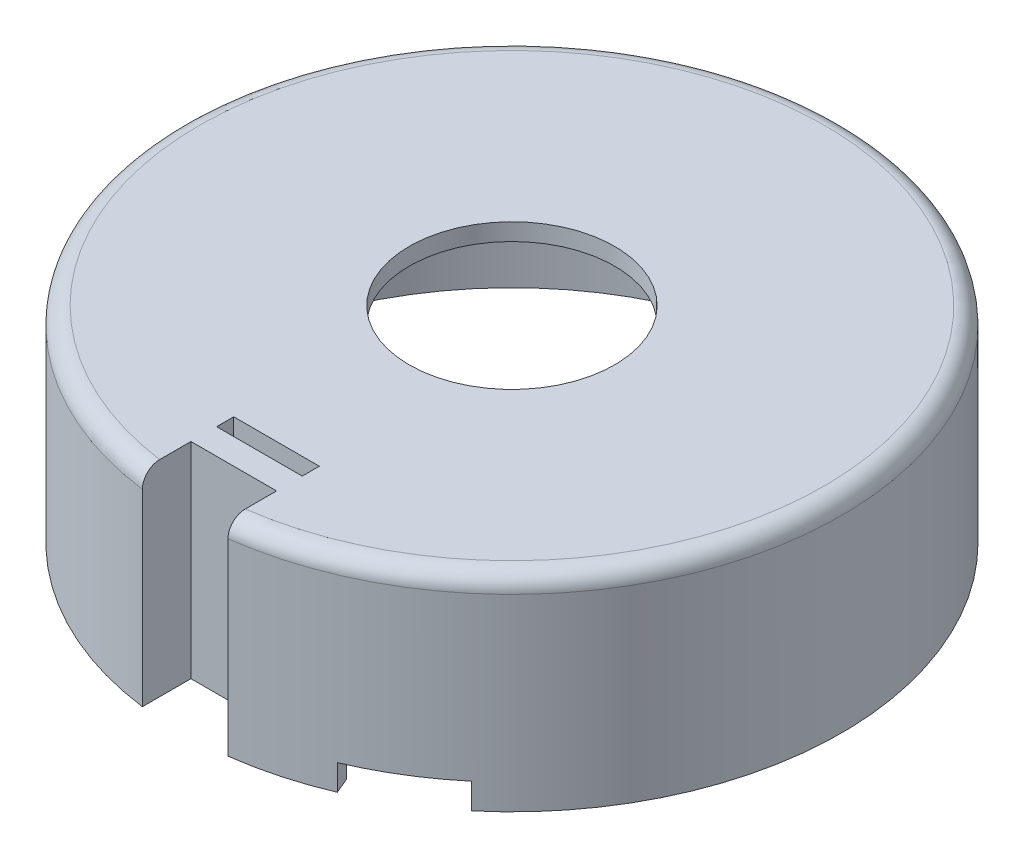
ISO-10303-21;
HEADER;
FILE_DESCRIPTION(('STEP AP214'),'2;1');
FILE_NAME('part.step','',(''),(''),'','','');
FILE_SCHEMA(('AUTOMOTIVE_DESIGN { 1 0 10303 214 1 1 1 1 }'));
ENDSEC;
DATA;
#1=APPLICATION_CONTEXT('core data for automotive mechanical design processes');
#2=APPLICATION_PROTOCOL_DEFINITION('international standard','automotive_design',2000,#1);
#3=PRODUCT_CONTEXT('',#1,'mechanical');
#4=PRODUCT('Part','Part','',(#3));
#5=PRODUCT_RELATED_PRODUCT_CATEGORY('part','',(#4));
#6=PRODUCT_DEFINITION_FORMATION('','',#4);
#7=PRODUCT_DEFINITION_CONTEXT('part definition',#1,'design');
#8=PRODUCT_DEFINITION('design','',#6,#7);
#9=PRODUCT_DEFINITION_SHAPE('','',#8);
#10=(LENGTH_UNIT() NAMED_UNIT(*) SI_UNIT(.MILLI.,.METRE.));
#11=(NAMED_UNIT(*) PLANE_ANGLE_UNIT() SI_UNIT($,.RADIAN.));
#12=(NAMED_UNIT(*) SI_UNIT($,.STERADIAN.) SOLID_ANGLE_UNIT());
#13=UNCERTAINTY_MEASURE_WITH_UNIT(LENGTH_MEASURE(1.E-05),#10,'distance_accuracy_value','');
#14=(GEOMETRIC_REPRESENTATION_CONTEXT(3) GLOBAL_UNCERTAINTY_ASSIGNED_CONTEXT((#13)) GLOBAL_UNIT_ASSIGNED_CONTEXT((#10,
#11,#12)) REPRESENTATION_CONTEXT('',''));
#15=CARTESIAN_POINT('',(0.,0.,0.));
#16=DIRECTION('',(0.,0.,1.));
#17=DIRECTION('',(1.,0.,0.));
#18=AXIS2_PLACEMENT_3D('',#15,#16,#17);
#19=CARTESIAN_POINT('',(0.,0.,0.));
#20=DIRECTION('',(0.,1.,0.));
#21=DIRECTION('',(0.,0.,1.));
#22=AXIS2_PLACEMENT_3D('',#19,#20,#21);
#23=PLANE('',#22);
#24=CARTESIAN_POINT('',(0.,0.,0.));
#25=DIRECTION('',(0.,1.,0.));
#26=DIRECTION('',(0.,0.,1.));
#27=AXIS2_PLACEMENT_3D('',#24,#25,#26);
#28=CIRCLE('',#27,19.25);
#29=CARTESIAN_POINT('',(-18.9575492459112,0.,3.34272741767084));
#30=VERTEX_POINT('',#29);
#31=CARTESIAN_POINT('',(-2.49999999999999,0.,19.0869719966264));
#32=VERTEX_POINT('',#31);
#33=EDGE_CURVE('E285',#30,#32,#28,.T.);
#34=ORIENTED_EDGE('',*,*,#33,.F.);
#35=DIRECTION('',(-0.984807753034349,0.,0.173648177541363));
#36=VECTOR('',#35,1.);
#37=CARTESIAN_POINT('',(-17.9727414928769,0.,3.16907924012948));
#38=LINE('',#37,#36);
#39=CARTESIAN_POINT('',(-17.9727414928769,0.,3.16907924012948));
#40=VERTEX_POINT('',#39);
#41=EDGE_CURVE('E279',#40,#30,#38,.T.);
#42=ORIENTED_EDGE('',*,*,#41,.F.);
#43=CARTESIAN_POINT('',(0.,0.,0.));
#44=DIRECTION('',(0.,1.,0.));
#45=DIRECTION('',(0.,0.,1.));
#46=AXIS2_PLACEMENT_3D('',#43,#44,#45);
#47=CIRCLE('',#46,18.25);
#48=CARTESIAN_POINT('',(-3.49999999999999,0.,17.911239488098));
#49=VERTEX_POINT('',#48);
#50=EDGE_CURVE('E421',#40,#49,#47,.T.);
#51=ORIENTED_EDGE('',*,*,#50,.T.);
#52=DIRECTION('',(0.,0.,-1.));
#53=VECTOR('',#52,1.);
#54=CARTESIAN_POINT('',(-3.49999999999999,0.,15.25));
#55=LINE('',#54,#53);
#56=CARTESIAN_POINT('',(-3.49999999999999,0.,15.25));
#57=VERTEX_POINT('',#56);
#58=EDGE_CURVE('E429',#49,#57,#55,.T.);
#59=ORIENTED_EDGE('',*,*,#58,.T.);
#60=DIRECTION('',(1.,0.,0.));
#61=VECTOR('',#60,1.);
#62=CARTESIAN_POINT('',(3.50000000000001,0.,15.25));
#63=LINE('',#62,#61);
#64=CARTESIAN_POINT('',(3.50000000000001,0.,15.25));
#65=VERTEX_POINT('',#64);
#66=EDGE_CURVE('E433',#57,#65,#63,.T.);
#67=ORIENTED_EDGE('',*,*,#66,.T.);
#68=DIRECTION('',(0.,0.,1.));
#69=VECTOR('',#68,1.);
#70=CARTESIAN_POINT('',(3.50000000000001,0.,17.911239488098));
#71=LINE('',#70,#69);
#72=CARTESIAN_POINT('',(3.50000000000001,0.,17.911239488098));
#73=VERTEX_POINT('',#72);
#74=EDGE_CURVE('E436',#65,#73,#71,.T.);
#75=ORIENTED_EDGE('',*,*,#74,.T.);
#76=CARTESIAN_POINT('',(7.13084309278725,0.,16.7992135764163));
#77=VERTEX_POINT('',#76);
#78=EDGE_CURVE('E424',#73,#77,#47,.T.);
#79=ORIENTED_EDGE('',*,*,#78,.T.);
#80=DIRECTION('',(-0.390731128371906,0.,-0.920504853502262));
#81=VECTOR('',#80,1.);
#82=CARTESIAN_POINT('',(7.13084309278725,0.,16.7992135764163));
#83=LINE('',#82,#81);
#84=CARTESIAN_POINT('',(7.52157422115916,0.,17.7197184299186));
#85=VERTEX_POINT('',#84);
#86=EDGE_CURVE('E476',#85,#77,#83,.T.);
#87=ORIENTED_EDGE('',*,*,#86,.F.);
#88=CARTESIAN_POINT('',(2.50000000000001,0.,19.0869719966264));
#89=VERTEX_POINT('',#88);
#90=EDGE_CURVE('E288',#89,#85,#28,.T.);
#91=ORIENTED_EDGE('',*,*,#90,.F.);
#92=DIRECTION('',(0.,0.,1.));
#93=VECTOR('',#92,1.);
#94=CARTESIAN_POINT('',(2.50000000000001,0.,16.25));
#95=LINE('',#94,#93);
#96=CARTESIAN_POINT('',(2.50000000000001,0.,16.25));
#97=VERTEX_POINT('',#96);
#98=EDGE_CURVE('E298',#97,#89,#95,.T.);
#99=ORIENTED_EDGE('',*,*,#98,.F.);
#100=DIRECTION('',(1.,0.,0.));
#101=VECTOR('',#100,1.);
#102=CARTESIAN_POINT('',(-2.49999999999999,0.,16.25));
#103=LINE('',#102,#101);
#104=CARTESIAN_POINT('',(-2.49999999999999,0.,16.25));
#105=VERTEX_POINT('',#104);
#106=EDGE_CURVE('E296',#105,#97,#103,.T.);
#107=ORIENTED_EDGE('',*,*,#106,.F.);
#108=DIRECTION('',(0.,0.,-1.));
#109=VECTOR('',#108,1.);
#110=CARTESIAN_POINT('',(-2.49999999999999,0.,19.0869719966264));
#111=LINE('',#110,#109);
#112=EDGE_CURVE('E293',#32,#105,#111,.T.);
#113=ORIENTED_EDGE('',*,*,#112,.F.);
#114=EDGE_LOOP('',(#34,#42,#51,#59,#67,#75,#79,#87,#91,#99,#107,#113));
#115=FACE_BOUND('',#114,.T.);
#116=ADVANCED_FACE('F51',(#115),#23,.F.);
#117=CARTESIAN_POINT('',(6.24186761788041,0.,-17.1493903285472));
#118=VERTEX_POINT('',#117);
#119=CARTESIAN_POINT('',(-18.1139672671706,0.,-2.224115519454));
#120=VERTEX_POINT('',#119);
#121=EDGE_CURVE('E278',#118,#120,#47,.T.);
#122=ORIENTED_EDGE('',*,*,#121,.T.);
#123=DIRECTION('',(0.992546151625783,0.,0.121869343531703));
#124=VECTOR('',#123,1.);
#125=CARTESIAN_POINT('',(-18.1139672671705,0.,-2.224115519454));
#126=LINE('',#125,#124);
#127=CARTESIAN_POINT('',(-19.1065134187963,0.,-2.34598486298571));
#128=VERTEX_POINT('',#127);
#129=EDGE_CURVE('E262',#128,#120,#126,.T.);
#130=ORIENTED_EDGE('',*,*,#129,.F.);
#131=CARTESIAN_POINT('',(6.58388776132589,0.,-18.0890829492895));
#132=VERTEX_POINT('',#131);
#133=EDGE_CURVE('E276',#132,#128,#28,.T.);
#134=ORIENTED_EDGE('',*,*,#133,.F.);
#135=DIRECTION('',(0.342020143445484,0.,-0.939692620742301));
#136=VECTOR('',#135,1.);
#137=CARTESIAN_POINT('',(6.24186761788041,0.,-17.1493903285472));
#138=LINE('',#137,#136);
#139=EDGE_CURVE('E829',#118,#132,#138,.T.);
#140=ORIENTED_EDGE('',*,*,#139,.F.);
#141=EDGE_LOOP('',(#122,#130,#134,#140));
#142=FACE_BOUND('',#141,.T.);
#143=ADVANCED_FACE('F274',(#142),#23,.F.);
#144=CARTESIAN_POINT('',(0.,11.,0.));
#145=DIRECTION('',(0.,-1.,0.));
#146=DIRECTION('',(0.,0.,-1.));
#147=AXIS2_PLACEMENT_3D('',#144,#145,#146);
#148=CYLINDRICAL_SURFACE('',#147,18.25);
#149=DIRECTION('',(0.,-1.,0.));
#150=VECTOR('',#149,1.);
#151=CARTESIAN_POINT('',(-17.9727414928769,1.5,3.16907924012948));
#152=LINE('',#151,#150);
#153=CARTESIAN_POINT('',(-17.9727414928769,1.5,3.16907924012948));
#154=VERTEX_POINT('',#153);
#155=EDGE_CURVE('E825',#154,#40,#152,.T.);
#156=ORIENTED_EDGE('',*,*,#155,.F.);
#157=CARTESIAN_POINT('',(2.22928074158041E-13,1.5,-4.12250886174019E-13));
#158=DIRECTION('',(0.,1.,0.));
#159=DIRECTION('',(0.,0.,-1.));
#160=AXIS2_PLACEMENT_3D('',#157,#158,#159);
#161=CIRCLE('',#160,18.2500000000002);
#162=CARTESIAN_POINT('',(-18.1139672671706,1.5,-2.224115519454));
#163=VERTEX_POINT('',#162);
#164=EDGE_CURVE('E817',#163,#154,#161,.T.);
#165=ORIENTED_EDGE('',*,*,#164,.F.);
#166=DIRECTION('',(0.,-1.,0.));
#167=VECTOR('',#166,1.);
#168=CARTESIAN_POINT('',(-18.1139672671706,1.5,-2.224115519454));
#169=LINE('',#168,#167);
#170=EDGE_CURVE('E269',#163,#120,#169,.T.);
#171=ORIENTED_EDGE('',*,*,#170,.T.);
#172=ORIENTED_EDGE('',*,*,#121,.F.);
#173=DIRECTION('',(0.,-1.,0.));
#174=VECTOR('',#173,1.);
#175=CARTESIAN_POINT('',(6.24186761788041,1.49999999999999,-17.1493903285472));
#176=LINE('',#175,#174);
#177=CARTESIAN_POINT('',(6.24186761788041,1.49999999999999,-17.1493903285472));
#178=VERTEX_POINT('',#177);
#179=EDGE_CURVE('E841',#178,#118,#176,.T.);
#180=ORIENTED_EDGE('',*,*,#179,.F.);
#181=CARTESIAN_POINT('',(4.69307668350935E-13,1.5,0.));
#182=DIRECTION('',(0.,1.,0.));
#183=DIRECTION('',(0.,0.,-1.));
#184=AXIS2_PLACEMENT_3D('',#181,#182,#183);
#185=CIRCLE('',#184,18.2500000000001);
#186=CARTESIAN_POINT('',(10.9831241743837,1.49999999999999,-14.575098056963));
#187=VERTEX_POINT('',#186);
#188=EDGE_CURVE('E836',#187,#178,#185,.T.);
#189=ORIENTED_EDGE('',*,*,#188,.F.);
#190=DIRECTION('',(0.,-1.,0.));
#191=VECTOR('',#190,1.);
#192=CARTESIAN_POINT('',(10.9831241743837,1.49999999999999,-14.575098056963));
#193=LINE('',#192,#191);
#194=CARTESIAN_POINT('',(10.9831241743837,0.,-14.575098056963));
#195=VERTEX_POINT('',#194);
#196=EDGE_CURVE('E843',#187,#195,#193,.T.);
#197=ORIENTED_EDGE('',*,*,#196,.T.);
#198=CARTESIAN_POINT('',(11.7308738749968,0.,13.9803110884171));
#199=VERTEX_POINT('',#198);
#200=EDGE_CURVE('E430',#199,#195,#47,.T.);
#201=ORIENTED_EDGE('',*,*,#200,.F.);
#202=DIRECTION('',(0.,-1.,0.));
#203=VECTOR('',#202,1.);
#204=CARTESIAN_POINT('',(11.7308738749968,1.50000000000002,13.9803110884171));
#205=LINE('',#204,#203);
#206=CARTESIAN_POINT('',(11.7308738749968,1.50000000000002,13.9803110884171));
#207=VERTEX_POINT('',#206);
#208=EDGE_CURVE('E490',#207,#199,#205,.T.);
#209=ORIENTED_EDGE('',*,*,#208,.F.);
#210=CARTESIAN_POINT('',(0.,1.5,0.));
#211=DIRECTION('',(0.,1.,0.));
#212=DIRECTION('',(0.,0.,-1.));
#213=AXIS2_PLACEMENT_3D('',#210,#211,#212);
#214=CIRCLE('',#213,18.25);
#215=CARTESIAN_POINT('',(7.13084309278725,1.50000000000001,16.7992135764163));
#216=VERTEX_POINT('',#215);
#217=EDGE_CURVE('E492',#216,#207,#214,.T.);
#218=ORIENTED_EDGE('',*,*,#217,.F.);
#219=DIRECTION('',(0.,-1.,0.));
#220=VECTOR('',#219,1.);
#221=CARTESIAN_POINT('',(7.13084309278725,1.50000000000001,16.7992135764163));
#222=LINE('',#221,#220);
#223=EDGE_CURVE('E473',#216,#77,#222,.T.);
#224=ORIENTED_EDGE('',*,*,#223,.T.);
#225=ORIENTED_EDGE('',*,*,#78,.F.);
#226=DIRECTION('',(0.,-1.,0.));
#227=VECTOR('',#226,1.);
#228=CARTESIAN_POINT('',(3.50000000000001,11.,17.911239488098));
#229=LINE('',#228,#227);
#230=CARTESIAN_POINT('',(3.50000000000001,11.,17.911239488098));
#231=VERTEX_POINT('',#230);
#232=EDGE_CURVE('E454',#231,#73,#229,.T.);
#233=ORIENTED_EDGE('',*,*,#232,.F.);
#234=CARTESIAN_POINT('',(0.,11.,0.));
#235=DIRECTION('',(0.,1.,0.));
#236=DIRECTION('',(0.,0.,1.));
#237=AXIS2_PLACEMENT_3D('',#234,#235,#236);
#238=CIRCLE('',#237,18.25);
#239=CARTESIAN_POINT('',(14.9348567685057,11.0000000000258,10.4886869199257));
#240=VERTEX_POINT('',#239);
#241=EDGE_CURVE('E440',#231,#240,#238,.T.);
#242=ORIENTED_EDGE('',*,*,#241,.T.);
#243=DIRECTION('',(0.,-1.,0.));
#244=VECTOR('',#243,1.);
#245=CARTESIAN_POINT('',(14.9348567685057,5.50000000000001,10.4886869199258));
#246=LINE('',#245,#244);
#247=CARTESIAN_POINT('',(14.9348567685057,2.00000000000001,10.4886869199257));
#248=VERTEX_POINT('',#247);
#249=EDGE_CURVE('E518',#248,#240,#246,.F.);
#250=ORIENTED_EDGE('',*,*,#249,.F.);
#251=CARTESIAN_POINT('',(0.,2.,0.));
#252=DIRECTION('',(0.,1.,0.));
#253=DIRECTION('',(0.,0.,1.));
#254=AXIS2_PLACEMENT_3D('',#251,#252,#253);
#255=CIRCLE('',#254,18.25);
#256=CARTESIAN_POINT('',(16.5508977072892,2.00000000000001,7.68962190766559));
#257=VERTEX_POINT('',#256);
#258=EDGE_CURVE('E521',#257,#248,#255,.F.);
#259=ORIENTED_EDGE('',*,*,#258,.F.);
#260=DIRECTION('',(0.,-1.,0.));
#261=VECTOR('',#260,1.);
#262=CARTESIAN_POINT('',(16.5508977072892,5.5,7.68962190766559));
#263=LINE('',#262,#261);
#264=CARTESIAN_POINT('',(16.5508977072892,11.0000000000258,7.6896219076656));
#265=VERTEX_POINT('',#264);
#266=EDGE_CURVE('E520',#265,#257,#263,.T.);
#267=ORIENTED_EDGE('',*,*,#266,.F.);
#268=CARTESIAN_POINT('',(1.6160409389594,11.0000000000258,-18.1783088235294));
#269=VERTEX_POINT('',#268);
#270=EDGE_CURVE('E444',#265,#269,#238,.T.);
#271=ORIENTED_EDGE('',*,*,#270,.T.);
#272=DIRECTION('',(0.,-1.,0.));
#273=VECTOR('',#272,1.);
#274=CARTESIAN_POINT('',(1.61604093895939,5.49999999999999,-18.1783088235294));
#275=LINE('',#274,#273);
#276=CARTESIAN_POINT('',(1.61604093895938,1.99999999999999,-18.1783088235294));
#277=VERTEX_POINT('',#276);
#278=EDGE_CURVE('E537',#277,#269,#275,.F.);
#279=ORIENTED_EDGE('',*,*,#278,.F.);
#280=CARTESIAN_POINT('',(0.,2.,0.));
#281=DIRECTION('',(0.,1.,0.));
#282=DIRECTION('',(0.,0.,1.));
#283=AXIS2_PLACEMENT_3D('',#280,#281,#282);
#284=CIRCLE('',#283,18.25);
#285=CARTESIAN_POINT('',(-1.6160409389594,1.99999999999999,-18.1783088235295));
#286=VERTEX_POINT('',#285);
#287=EDGE_CURVE('E541',#286,#277,#284,.F.);
#288=ORIENTED_EDGE('',*,*,#287,.F.);
#289=DIRECTION('',(0.,-1.,0.));
#290=VECTOR('',#289,1.);
#291=CARTESIAN_POINT('',(-1.61604093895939,5.49999999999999,-18.1783088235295));
#292=LINE('',#291,#290);
#293=CARTESIAN_POINT('',(-1.61604093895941,11.0000000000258,-18.1783088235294));
#294=VERTEX_POINT('',#293);
#295=EDGE_CURVE('E540',#294,#286,#292,.T.);
#296=ORIENTED_EDGE('',*,*,#295,.F.);
#297=CARTESIAN_POINT('',(-16.5508977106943,11.0000000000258,7.68962190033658));
#298=VERTEX_POINT('',#297);
#299=EDGE_CURVE('E445',#294,#298,#238,.T.);
#300=ORIENTED_EDGE('',*,*,#299,.T.);
#301=DIRECTION('',(0.,-1.,0.));
#302=VECTOR('',#301,1.);
#303=CARTESIAN_POINT('',(-16.5508977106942,5.5,7.68962190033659));
#304=LINE('',#303,#302);
#305=CARTESIAN_POINT('',(-16.5508977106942,2.,7.68962190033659));
#306=VERTEX_POINT('',#305);
#307=EDGE_CURVE('E496',#306,#298,#304,.F.);
#308=ORIENTED_EDGE('',*,*,#307,.F.);
#309=CARTESIAN_POINT('',(0.,2.,0.));
#310=DIRECTION('',(0.,1.,0.));
#311=DIRECTION('',(0.,0.,1.));
#312=AXIS2_PLACEMENT_3D('',#309,#310,#311);
#313=CIRCLE('',#312,18.25);
#314=CARTESIAN_POINT('',(-14.9348567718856,2.,10.4886869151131));
#315=VERTEX_POINT('',#314);
#316=EDGE_CURVE('E500',#315,#306,#313,.F.);
#317=ORIENTED_EDGE('',*,*,#316,.F.);
#318=DIRECTION('',(0.,-1.,0.));
#319=VECTOR('',#318,1.);
#320=CARTESIAN_POINT('',(-14.9348567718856,5.50000000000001,10.4886869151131));
#321=LINE('',#320,#319);
#322=CARTESIAN_POINT('',(-14.9348567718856,11.0000000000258,10.4886869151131));
#323=VERTEX_POINT('',#322);
#324=EDGE_CURVE('E499',#323,#315,#321,.T.);
#325=ORIENTED_EDGE('',*,*,#324,.F.);
#326=CARTESIAN_POINT('',(-3.49999999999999,11.0000000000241,17.911239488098));
#327=VERTEX_POINT('',#326);
#328=EDGE_CURVE('E439',#323,#327,#238,.T.);
#329=ORIENTED_EDGE('',*,*,#328,.T.);
#330=DIRECTION('',(0.,-1.,0.));
#331=VECTOR('',#330,1.);
#332=CARTESIAN_POINT('',(-3.49999999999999,11.,17.911239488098));
#333=LINE('',#332,#331);
#334=EDGE_CURVE('E289',#327,#49,#333,.T.);
#335=ORIENTED_EDGE('',*,*,#334,.T.);
#336=ORIENTED_EDGE('',*,*,#50,.F.);
#337=EDGE_LOOP('',(#156,#165,#171,#172,#180,#189,#197,#201,#209,#218,#224,#225,#233,#242,#250,
#259,#267,#271,#279,#288,#296,#300,#308,#317,#325,#329,#335,#336));
#338=FACE_BOUND('',#337,.T.);
#339=ADVANCED_FACE('F342',(#338),#148,.F.);
#340=CARTESIAN_POINT('',(1.09584856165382E-13,11.0000000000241,3.25994034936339E-13));
#341=DIRECTION('',(0.,1.,0.));
#342=DIRECTION('',(0.,0.,1.));
#343=AXIS2_PLACEMENT_3D('',#340,#341,#342);
#344=PLANE('',#343);
#345=DIRECTION('',(0.,0.,1.));
#346=VECTOR('',#345,1.);
#347=CARTESIAN_POINT('',(-2.49999999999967,11.0000000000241,14.7500000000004));
#348=LINE('',#347,#346);
#349=CARTESIAN_POINT('',(-2.49999999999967,11.0000000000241,13.7500000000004));
#350=VERTEX_POINT('',#349);
#351=CARTESIAN_POINT('',(-2.49999999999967,11.0000000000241,14.7500000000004));
#352=VERTEX_POINT('',#351);
#353=EDGE_CURVE('E562',#350,#352,#348,.T.);
#354=ORIENTED_EDGE('',*,*,#353,.T.);
#355=DIRECTION('',(1.,0.,0.));
#356=VECTOR('',#355,1.);
#357=CARTESIAN_POINT('',(-2.49999999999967,11.0000000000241,14.7500000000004));
#358=LINE('',#357,#356);
#359=CARTESIAN_POINT('',(2.50000000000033,11.0000000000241,14.7500000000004));
#360=VERTEX_POINT('',#359);
#361=EDGE_CURVE('E565',#352,#360,#358,.T.);
#362=ORIENTED_EDGE('',*,*,#361,.T.);
#363=DIRECTION('',(0.,0.,-1.));
#364=VECTOR('',#363,1.);
#365=CARTESIAN_POINT('',(2.50000000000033,11.0000000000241,14.7500000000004));
#366=LINE('',#365,#364);
#367=CARTESIAN_POINT('',(2.50000000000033,11.0000000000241,13.7500000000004));
#368=VERTEX_POINT('',#367);
#369=EDGE_CURVE('E568',#360,#368,#366,.T.);
#370=ORIENTED_EDGE('',*,*,#369,.T.);
#371=DIRECTION('',(-1.,0.,0.));
#372=VECTOR('',#371,1.);
#373=CARTESIAN_POINT('',(-2.49999999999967,11.0000000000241,13.7500000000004));
#374=LINE('',#373,#372);
#375=EDGE_CURVE('E571',#368,#350,#374,.T.);
#376=ORIENTED_EDGE('',*,*,#375,.T.);
#377=EDGE_LOOP('',(#354,#362,#370,#376));
#378=FACE_BOUND('',#377,.T.);
#379=CARTESIAN_POINT('',(1.09584856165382E-13,11.0000000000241,3.25994034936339E-13));
#380=DIRECTION('',(0.,1.,0.));
#381=DIRECTION('',(0.,0.,1.));
#382=AXIS2_PLACEMENT_3D('',#379,#380,#381);
#383=CIRCLE('',#382,6.);
#384=CARTESIAN_POINT('',(1.11250190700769E-13,11.0000000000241,6.00000000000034));
#385=VERTEX_POINT('',#384);
#386=EDGE_CURVE('E557',#385,#385,#383,.T.);
#387=ORIENTED_EDGE('',*,*,#386,.T.);
#388=EDGE_LOOP('',(#387));
#389=FACE_BOUND('',#388,.T.);
#390=CARTESIAN_POINT('',(-14.722431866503,11.0000000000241,8.49999999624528));
#391=DIRECTION('',(0.,1.,0.));
#392=DIRECTION('',(0.,0.,1.));
#393=AXIS2_PLACEMENT_3D('',#390,#391,#392);
#394=CIRCLE('',#393,2.00000000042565);
#395=EDGE_CURVE('E506',#323,#298,#394,.T.);
#396=ORIENTED_EDGE('',*,*,#395,.T.);
#397=ORIENTED_EDGE('',*,*,#299,.F.);
#398=CARTESIAN_POINT('',(0.,11.0000000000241,-17.));
#399=DIRECTION('',(0.,1.,0.));
#400=DIRECTION('',(0.,0.,1.));
#401=AXIS2_PLACEMENT_3D('',#398,#399,#400);
#402=CIRCLE('',#401,2.);
#403=EDGE_CURVE('E547',#294,#269,#402,.T.);
#404=ORIENTED_EDGE('',*,*,#403,.T.);
#405=ORIENTED_EDGE('',*,*,#270,.F.);
#406=CARTESIAN_POINT('',(14.72243186,11.0000000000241,8.49999999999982));
#407=DIRECTION('',(0.,1.,0.));
#408=DIRECTION('',(0.,0.,1.));
#409=AXIS2_PLACEMENT_3D('',#406,#407,#408);
#410=CIRCLE('',#409,2.00000000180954);
#411=EDGE_CURVE('E527',#265,#240,#410,.T.);
#412=ORIENTED_EDGE('',*,*,#411,.T.);
#413=ORIENTED_EDGE('',*,*,#241,.F.);
#414=DIRECTION('',(0.,0.,1.));
#415=VECTOR('',#414,1.);
#416=CARTESIAN_POINT('',(3.50000000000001,11.,17.911239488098));
#417=LINE('',#416,#415);
#418=CARTESIAN_POINT('',(3.50000000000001,11.0000000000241,15.25));
#419=VERTEX_POINT('',#418);
#420=EDGE_CURVE('E451',#419,#231,#417,.T.);
#421=ORIENTED_EDGE('',*,*,#420,.F.);
#422=DIRECTION('',(1.,0.,0.));
#423=VECTOR('',#422,1.);
#424=CARTESIAN_POINT('',(3.50000000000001,11.,15.25));
#425=LINE('',#424,#423);
#426=CARTESIAN_POINT('',(-3.49999999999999,11.0000000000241,15.25));
#427=VERTEX_POINT('',#426);
#428=EDGE_CURVE('E448',#427,#419,#425,.T.);
#429=ORIENTED_EDGE('',*,*,#428,.F.);
#430=DIRECTION('',(0.,0.,-1.));
#431=VECTOR('',#430,1.);
#432=CARTESIAN_POINT('',(-3.49999999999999,11.,15.25));
#433=LINE('',#432,#431);
#434=EDGE_CURVE('E443',#327,#427,#433,.T.);
#435=ORIENTED_EDGE('',*,*,#434,.F.);
#436=ORIENTED_EDGE('',*,*,#328,.F.);
#437=EDGE_LOOP('',(#396,#397,#404,#405,#412,#413,#421,#429,#435,#436));
#438=FACE_BOUND('',#437,.T.);
#439=ADVANCED_FACE('F340',(#378,#389,#438),#344,.F.);
#440=ORIENTED_EDGE('',*,*,#200,.T.);
#441=DIRECTION('',(-0.601815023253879,0.,0.798635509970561));
#442=VECTOR('',#441,1.);
#443=CARTESIAN_POINT('',(10.9831241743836,0.,-14.5750980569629));
#444=LINE('',#443,#442);
#445=CARTESIAN_POINT('',(11.5849391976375,0.,-15.3737335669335));
#446=VERTEX_POINT('',#445);
#447=EDGE_CURVE('E824',#446,#195,#444,.T.);
#448=ORIENTED_EDGE('',*,*,#447,.F.);
#449=CARTESIAN_POINT('',(12.3736614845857,0.,14.746355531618));
#450=VERTEX_POINT('',#449);
#451=EDGE_CURVE('E284',#450,#446,#28,.T.);
#452=ORIENTED_EDGE('',*,*,#451,.F.);
#453=DIRECTION('',(0.642787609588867,0.,0.766044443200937));
#454=VECTOR('',#453,1.);
#455=CARTESIAN_POINT('',(11.7308738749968,0.,13.9803110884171));
#456=LINE('',#455,#454);
#457=EDGE_CURVE('E479',#199,#450,#456,.T.);
#458=ORIENTED_EDGE('',*,*,#457,.F.);
#459=EDGE_LOOP('',(#440,#448,#452,#458));
#460=FACE_BOUND('',#459,.T.);
#461=ADVANCED_FACE('F337',(#460),#23,.F.);
#462=CARTESIAN_POINT('',(0.,11.,0.));
#463=DIRECTION('',(0.,-1.,0.));
#464=DIRECTION('',(0.,0.,-1.));
#465=AXIS2_PLACEMENT_3D('',#462,#463,#464);
#466=CYLINDRICAL_SURFACE('',#465,19.25);
#467=CARTESIAN_POINT('',(2.22928074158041E-13,1.5,-4.12250886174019E-13));
#468=DIRECTION('',(0.,-1.,0.));
#469=DIRECTION('',(0.,0.,-1.));
#470=AXIS2_PLACEMENT_3D('',#467,#468,#469);
#471=CIRCLE('',#470,19.2500000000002);
#472=CARTESIAN_POINT('',(-18.9575492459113,1.5,3.34272741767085));
#473=VERTEX_POINT('',#472);
#474=CARTESIAN_POINT('',(-19.1065134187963,1.5,-2.34598486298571));
#475=VERTEX_POINT('',#474);
#476=EDGE_CURVE('E814',#473,#475,#471,.T.);
#477=ORIENTED_EDGE('',*,*,#476,.F.);
#478=DIRECTION('',(0.,-1.,0.));
#479=VECTOR('',#478,1.);
#480=CARTESIAN_POINT('',(-18.9575492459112,1.5,3.34272741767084));
#481=LINE('',#480,#479);
#482=EDGE_CURVE('E407',#473,#30,#481,.T.);
#483=ORIENTED_EDGE('',*,*,#482,.T.);
#484=ORIENTED_EDGE('',*,*,#33,.T.);
#485=DIRECTION('',(0.,-1.,0.));
#486=VECTOR('',#485,1.);
#487=CARTESIAN_POINT('',(-2.49999999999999,11.,19.0869719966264));
#488=LINE('',#487,#486);
#489=CARTESIAN_POINT('',(-2.49999999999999,11.0000000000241,19.0869719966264));
#490=VERTEX_POINT('',#489);
#491=EDGE_CURVE('E309',#490,#32,#488,.T.);
#492=ORIENTED_EDGE('',*,*,#491,.F.);
#493=CARTESIAN_POINT('',(0.,11.0000000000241,0.));
#494=DIRECTION('',(0.,1.,0.));
#495=DIRECTION('',(0.,0.,1.));
#496=AXIS2_PLACEMENT_3D('',#493,#494,#495);
#497=CIRCLE('',#496,19.25);
#498=CARTESIAN_POINT('',(2.50000000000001,11.0000000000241,19.0869719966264));
#499=VERTEX_POINT('',#498);
#500=EDGE_CURVE('E64',#490,#499,#497,.F.);
#501=ORIENTED_EDGE('',*,*,#500,.T.);
#502=DIRECTION('',(0.,-1.,0.));
#503=VECTOR('',#502,1.);
#504=CARTESIAN_POINT('',(2.50000000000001,11.,19.0869719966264));
#505=LINE('',#504,#503);
#506=EDGE_CURVE('E301',#499,#89,#505,.T.);
#507=ORIENTED_EDGE('',*,*,#506,.T.);
#508=ORIENTED_EDGE('',*,*,#90,.T.);
#509=DIRECTION('',(0.,-1.,0.));
#510=VECTOR('',#509,1.);
#511=CARTESIAN_POINT('',(7.52157422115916,1.50000000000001,17.7197184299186));
#512=LINE('',#511,#510);
#513=CARTESIAN_POINT('',(7.52157422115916,1.50000000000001,17.7197184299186));
#514=VERTEX_POINT('',#513);
#515=EDGE_CURVE('E483',#514,#85,#512,.T.);
#516=ORIENTED_EDGE('',*,*,#515,.F.);
#517=CARTESIAN_POINT('',(0.,1.5,0.));
#518=DIRECTION('',(0.,-1.,0.));
#519=DIRECTION('',(0.,0.,-1.));
#520=AXIS2_PLACEMENT_3D('',#517,#518,#519);
#521=CIRCLE('',#520,19.25);
#522=CARTESIAN_POINT('',(12.3736614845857,1.50000000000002,14.746355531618));
#523=VERTEX_POINT('',#522);
#524=EDGE_CURVE('E487',#523,#514,#521,.T.);
#525=ORIENTED_EDGE('',*,*,#524,.F.);
#526=DIRECTION('',(0.,-1.,0.));
#527=VECTOR('',#526,1.);
#528=CARTESIAN_POINT('',(12.3736614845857,1.50000000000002,14.746355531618));
#529=LINE('',#528,#527);
#530=EDGE_CURVE('E513',#523,#450,#529,.T.);
#531=ORIENTED_EDGE('',*,*,#530,.T.);
#532=ORIENTED_EDGE('',*,*,#451,.T.);
#533=DIRECTION('',(0.,-1.,0.));
#534=VECTOR('',#533,1.);
#535=CARTESIAN_POINT('',(11.5849391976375,1.49999999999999,-15.3737335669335));
#536=LINE('',#535,#534);
#537=CARTESIAN_POINT('',(11.5849391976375,1.49999999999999,-15.3737335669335));
#538=VERTEX_POINT('',#537);
#539=EDGE_CURVE('E839',#538,#446,#536,.T.);
#540=ORIENTED_EDGE('',*,*,#539,.F.);
#541=CARTESIAN_POINT('',(4.69307668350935E-13,1.5,0.));
#542=DIRECTION('',(0.,-1.,0.));
#543=DIRECTION('',(0.,0.,-1.));
#544=AXIS2_PLACEMENT_3D('',#541,#542,#543);
#545=CIRCLE('',#544,19.2500000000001);
#546=CARTESIAN_POINT('',(6.58388776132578,1.49999999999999,-18.0890829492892));
#547=VERTEX_POINT('',#546);
#548=EDGE_CURVE('E831',#547,#538,#545,.T.);
#549=ORIENTED_EDGE('',*,*,#548,.F.);
#550=DIRECTION('',(0.,-1.,0.));
#551=VECTOR('',#550,1.);
#552=CARTESIAN_POINT('',(6.58388776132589,1.49999999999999,-18.0890829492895));
#553=LINE('',#552,#551);
#554=EDGE_CURVE('E283',#547,#132,#553,.T.);
#555=ORIENTED_EDGE('',*,*,#554,.T.);
#556=ORIENTED_EDGE('',*,*,#133,.T.);
#557=DIRECTION('',(0.,-1.,0.));
#558=VECTOR('',#557,1.);
#559=CARTESIAN_POINT('',(-19.1065134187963,1.5,-2.34598486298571));
#560=LINE('',#559,#558);
#561=EDGE_CURVE('E259',#475,#128,#560,.T.);
#562=ORIENTED_EDGE('',*,*,#561,.F.);
#563=EDGE_LOOP('',(#477,#483,#484,#492,#501,#507,#508,#516,#525,#531,#532,#540,#549,#555,#556,#562));
#564=FACE_BOUND('',#563,.T.);
#565=ADVANCED_FACE('F53',(#564),#466,.T.);
#566=CARTESIAN_POINT('',(-2.49999999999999,11.,19.0869719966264));
#567=DIRECTION('',(-1.,0.,0.));
#568=DIRECTION('',(0.,0.,1.));
#569=AXIS2_PLACEMENT_3D('',#566,#567,#568);
#570=PLANE('',#569);
#571=DIRECTION('',(0.,0.,-1.));
#572=VECTOR('',#571,1.);
#573=CARTESIAN_POINT('',(-2.49999999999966,12.0000000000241,19.0869719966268));
#574=LINE('',#573,#572);
#575=CARTESIAN_POINT('',(-2.49999999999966,12.0000000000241,18.077956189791));
#576=VERTEX_POINT('',#575);
#577=CARTESIAN_POINT('',(-2.49999999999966,12.0000000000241,16.2500000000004));
#578=VERTEX_POINT('',#577);
#579=EDGE_CURVE('E410',#576,#578,#574,.T.);
#580=ORIENTED_EDGE('',*,*,#579,.F.);
#581=CARTESIAN_POINT('',(-2.49999999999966,12.0000000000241,18.077956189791));
#582=CARTESIAN_POINT('',(-2.49999999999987,11.9999996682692,18.1065380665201));
#583=CARTESIAN_POINT('',(-2.49999999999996,11.9987968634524,18.135106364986));
#584=CARTESIAN_POINT('',(-2.50000000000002,11.9939967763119,18.1920403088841));
#585=CARTESIAN_POINT('',(-2.5,11.9903995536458,18.2204059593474));
#586=CARTESIAN_POINT('',(-2.49999999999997,11.9760449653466,18.3048608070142));
#587=CARTESIAN_POINT('',(-2.49999999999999,11.9617246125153,18.360387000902));
#588=CARTESIAN_POINT('',(-2.5,11.9239536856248,18.4682492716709));
#589=CARTESIAN_POINT('',(-2.49999999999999,11.9004976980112,18.520583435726));
#590=CARTESIAN_POINT('',(-2.49999999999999,11.8450961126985,18.620540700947));
#591=CARTESIAN_POINT('',(-2.49999999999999,11.8131527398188,18.6681650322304));
#592=CARTESIAN_POINT('',(-2.49999999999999,11.7418260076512,18.7571054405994));
#593=CARTESIAN_POINT('',(-2.49999999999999,11.7024779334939,18.7984498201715));
#594=CARTESIAN_POINT('',(-2.49999999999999,11.617335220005,18.8738855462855));
#595=CARTESIAN_POINT('',(-2.49999999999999,11.5715394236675,18.9079755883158));
#596=CARTESIAN_POINT('',(-2.49999999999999,11.4752269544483,18.9676169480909));
#597=CARTESIAN_POINT('',(-2.49999999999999,11.424753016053,18.9932373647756));
#598=CARTESIAN_POINT('',(-2.49999999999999,11.3202098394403,19.0355519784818));
#599=CARTESIAN_POINT('',(-2.49999999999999,11.2661431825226,19.0522525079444));
#600=CARTESIAN_POINT('',(-2.49999999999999,11.1764167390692,19.0717995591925));
#601=CARTESIAN_POINT('',(-2.49999999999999,11.1413502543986,19.0774859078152));
#602=CARTESIAN_POINT('',(-2.49999999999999,11.0708610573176,19.0850713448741));
#603=CARTESIAN_POINT('',(-2.49999999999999,11.035438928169,19.086975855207));
#604=CARTESIAN_POINT('',(-2.49999999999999,11.0000000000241,19.0869719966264));
#605=B_SPLINE_CURVE_WITH_KNOTS('',3,(#581,#582,#583,#584,#585,#586,#587,#588,#589,#590,#591,
#592,#593,#594,#595,#596,#597,#598,#599,#600,#601,#602,#603,#604),.UNSPECIFIED.,.F.,.F.,(4,2,2,
2,2,2,2,2,2,2,2,4),(0.,0.0856932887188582,0.171384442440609,0.342532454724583,0.513782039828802,
0.68498677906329,0.855395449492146,1.02583473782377,1.19484706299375,1.36373924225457,
1.47012475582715,1.57635763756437),.UNSPECIFIED.);
#606=EDGE_CURVE('E315',#576,#490,#605,.T.);
#607=ORIENTED_EDGE('',*,*,#606,.T.);
#608=ORIENTED_EDGE('',*,*,#491,.T.);
#609=ORIENTED_EDGE('',*,*,#112,.T.);
#610=DIRECTION('',(0.,-1.,0.));
#611=VECTOR('',#610,1.);
#612=CARTESIAN_POINT('',(-2.49999999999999,11.,16.2500000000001));
#613=LINE('',#612,#611);
#614=EDGE_CURVE('E306',#578,#105,#613,.T.);
#615=ORIENTED_EDGE('',*,*,#614,.F.);
#616=EDGE_LOOP('',(#580,#607,#608,#609,#615));
#617=FACE_BOUND('',#616,.T.);
#618=ADVANCED_FACE('F323',(#617),#570,.F.);
#619=CARTESIAN_POINT('',(-2.49999999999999,11.,16.2500000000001));
#620=DIRECTION('',(0.,0.,-1.));
#621=DIRECTION('',(-1.,0.,0.));
#622=AXIS2_PLACEMENT_3D('',#619,#620,#621);
#623=PLANE('',#622);
#624=ORIENTED_EDGE('',*,*,#106,.T.);
#625=DIRECTION('',(0.,-1.,0.));
#626=VECTOR('',#625,1.);
#627=CARTESIAN_POINT('',(2.50000000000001,11.,16.2500000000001));
#628=LINE('',#627,#626);
#629=CARTESIAN_POINT('',(2.50000000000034,12.0000000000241,16.2500000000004));
#630=VERTEX_POINT('',#629);
#631=EDGE_CURVE('E303',#630,#97,#628,.T.);
#632=ORIENTED_EDGE('',*,*,#631,.F.);
#633=DIRECTION('',(1.,0.,0.));
#634=VECTOR('',#633,1.);
#635=CARTESIAN_POINT('',(-2.49999999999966,12.0000000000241,16.2500000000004));
#636=LINE('',#635,#634);
#637=EDGE_CURVE('E420',#578,#630,#636,.T.);
#638=ORIENTED_EDGE('',*,*,#637,.F.);
#639=ORIENTED_EDGE('',*,*,#614,.T.);
#640=EDGE_LOOP('',(#624,#632,#638,#639));
#641=FACE_BOUND('',#640,.T.);
#642=ADVANCED_FACE('F327',(#641),#623,.F.);
#643=CARTESIAN_POINT('',(2.50000000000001,11.,16.2500000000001));
#644=DIRECTION('',(1.,0.,0.));
#645=DIRECTION('',(0.,0.,-1.));
#646=AXIS2_PLACEMENT_3D('',#643,#644,#645);
#647=PLANE('',#646);
#648=ORIENTED_EDGE('',*,*,#506,.F.);
#649=CARTESIAN_POINT('',(2.50000000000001,11.0000000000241,19.0869719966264));
#650=CARTESIAN_POINT('',(2.50000000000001,11.0279589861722,19.0869719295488));
#651=CARTESIAN_POINT('',(2.50000000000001,11.0559045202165,19.0857886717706));
#652=CARTESIAN_POINT('',(2.50000000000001,11.111594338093,19.0810689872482));
#653=CARTESIAN_POINT('',(2.50000000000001,11.1393386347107,19.0775327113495));
#654=CARTESIAN_POINT('',(2.50000000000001,11.2219100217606,19.0634316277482));
#655=CARTESIAN_POINT('',(2.50000000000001,11.2761819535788,19.0493744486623));
#656=CARTESIAN_POINT('',(2.50000000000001,11.3815906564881,19.0123554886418));
#657=CARTESIAN_POINT('',(2.50000000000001,11.4327261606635,18.9893901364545));
#658=CARTESIAN_POINT('',(2.50000000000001,11.5304356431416,18.9352319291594));
#659=CARTESIAN_POINT('',(2.50000000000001,11.5770101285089,18.9040399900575));
#660=CARTESIAN_POINT('',(2.50000000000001,11.6644652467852,18.8342087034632));
#661=CARTESIAN_POINT('',(2.50000000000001,11.7053248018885,18.7955429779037));
#662=CARTESIAN_POINT('',(2.50000000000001,11.7800436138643,18.7119414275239));
#663=CARTESIAN_POINT('',(2.50000000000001,11.8139014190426,18.6670043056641));
#664=CARTESIAN_POINT('',(2.50000000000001,11.873944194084,18.5717526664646));
#665=CARTESIAN_POINT('',(2.50000000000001,11.9000635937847,18.5213968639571));
#666=CARTESIAN_POINT('',(2.50000000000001,11.9435458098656,18.4170475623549));
#667=CARTESIAN_POINT('',(2.50000000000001,11.9609125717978,18.3630557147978));
#668=CARTESIAN_POINT('',(2.50000000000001,11.9824259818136,18.2703151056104));
#669=CARTESIAN_POINT('',(2.50000000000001,11.9890127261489,18.232113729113));
#670=CARTESIAN_POINT('',(2.50000000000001,11.9977993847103,18.1552651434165));
#671=CARTESIAN_POINT('',(2.50000000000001,12.0000055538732,18.1166186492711));
#672=CARTESIAN_POINT('',(2.50000000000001,12.0000000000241,18.0779561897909));
#673=B_SPLINE_CURVE_WITH_KNOTS('',3,(#649,#650,#651,#652,#653,#654,#655,#656,#657,#658,#659,
#660,#661,#662,#663,#664,#665,#666,#667,#668,#669,#670,#671,#672),.UNSPECIFIED.,.F.,.F.,(4,2,2,
2,2,2,2,2,2,2,2,4),(0.,0.0838252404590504,0.167645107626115,0.334969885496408,0.502361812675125,
0.669735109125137,0.83771029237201,1.00572026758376,1.17511560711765,1.34443451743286,
1.46049368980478,1.5763870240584),.UNSPECIFIED.);
#674=CARTESIAN_POINT('',(2.50000000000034,12.0000000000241,18.0779561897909));
#675=VERTEX_POINT('',#674);
#676=EDGE_CURVE('E12',#499,#675,#673,.T.);
#677=ORIENTED_EDGE('',*,*,#676,.T.);
#678=DIRECTION('',(0.,0.,1.));
#679=VECTOR('',#678,1.);
#680=CARTESIAN_POINT('',(2.50000000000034,12.0000000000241,16.2500000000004));
#681=LINE('',#680,#679);
#682=EDGE_CURVE('E418',#630,#675,#681,.T.);
#683=ORIENTED_EDGE('',*,*,#682,.F.);
#684=ORIENTED_EDGE('',*,*,#631,.T.);
#685=ORIENTED_EDGE('',*,*,#98,.T.);
#686=EDGE_LOOP('',(#648,#677,#683,#684,#685));
#687=FACE_BOUND('',#686,.T.);
#688=ADVANCED_FACE('F330',(#687),#647,.F.);
#689=CARTESIAN_POINT('',(-3.49999999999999,11.,15.25));
#690=DIRECTION('',(-1.,0.,0.));
#691=DIRECTION('',(0.,0.,1.));
#692=AXIS2_PLACEMENT_3D('',#689,#690,#691);
#693=PLANE('',#692);
#694=ORIENTED_EDGE('',*,*,#58,.F.);
#695=ORIENTED_EDGE('',*,*,#334,.F.);
#696=ORIENTED_EDGE('',*,*,#434,.T.);
#697=DIRECTION('',(0.,-1.,0.));
#698=VECTOR('',#697,1.);
#699=CARTESIAN_POINT('',(-3.49999999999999,11.,15.25));
#700=LINE('',#699,#698);
#701=EDGE_CURVE('E458',#427,#57,#700,.T.);
#702=ORIENTED_EDGE('',*,*,#701,.T.);
#703=EDGE_LOOP('',(#694,#695,#696,#702));
#704=FACE_BOUND('',#703,.T.);
#705=ADVANCED_FACE('F335',(#704),#693,.T.);
#706=CARTESIAN_POINT('',(3.50000000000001,11.,15.25));
#707=DIRECTION('',(0.,0.,-1.));
#708=DIRECTION('',(-1.,0.,0.));
#709=AXIS2_PLACEMENT_3D('',#706,#707,#708);
#710=PLANE('',#709);
#711=ORIENTED_EDGE('',*,*,#66,.F.);
#712=ORIENTED_EDGE('',*,*,#701,.F.);
#713=ORIENTED_EDGE('',*,*,#428,.T.);
#714=DIRECTION('',(0.,-1.,0.));
#715=VECTOR('',#714,1.);
#716=CARTESIAN_POINT('',(3.50000000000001,11.,15.25));
#717=LINE('',#716,#715);
#718=EDGE_CURVE('E457',#419,#65,#717,.T.);
#719=ORIENTED_EDGE('',*,*,#718,.T.);
#720=EDGE_LOOP('',(#711,#712,#713,#719));
#721=FACE_BOUND('',#720,.T.);
#722=ADVANCED_FACE('F348',(#721),#710,.T.);
#723=CARTESIAN_POINT('',(3.50000000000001,11.,17.911239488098));
#724=DIRECTION('',(1.,0.,0.));
#725=DIRECTION('',(0.,0.,-1.));
#726=AXIS2_PLACEMENT_3D('',#723,#724,#725);
#727=PLANE('',#726);
#728=ORIENTED_EDGE('',*,*,#74,.F.);
#729=ORIENTED_EDGE('',*,*,#718,.F.);
#730=ORIENTED_EDGE('',*,*,#420,.T.);
#731=ORIENTED_EDGE('',*,*,#232,.T.);
#732=EDGE_LOOP('',(#728,#729,#730,#731));
#733=FACE_BOUND('',#732,.T.);
#734=ADVANCED_FACE('F352',(#733),#727,.T.);
#735=CARTESIAN_POINT('',(1.09611881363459E-13,12.0000000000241,3.2661266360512E-13));
#736=DIRECTION('',(0.,1.,0.));
#737=DIRECTION('',(0.,0.,1.));
#738=AXIS2_PLACEMENT_3D('',#735,#736,#737);
#739=PLANE('',#738);
#740=DIRECTION('',(1.,0.,0.));
#741=VECTOR('',#740,1.);
#742=CARTESIAN_POINT('',(-2.49999999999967,12.0000000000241,14.7500000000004));
#743=LINE('',#742,#741);
#744=CARTESIAN_POINT('',(-2.49999999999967,12.0000000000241,14.7500000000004));
#745=VERTEX_POINT('',#744);
#746=CARTESIAN_POINT('',(2.50000000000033,12.0000000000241,14.7500000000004));
#747=VERTEX_POINT('',#746);
#748=EDGE_CURVE('E576',#745,#747,#743,.T.);
#749=ORIENTED_EDGE('',*,*,#748,.F.);
#750=DIRECTION('',(0.,0.,1.));
#751=VECTOR('',#750,1.);
#752=CARTESIAN_POINT('',(-2.49999999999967,12.0000000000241,14.7500000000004));
#753=LINE('',#752,#751);
#754=CARTESIAN_POINT('',(-2.49999999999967,12.0000000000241,13.7500000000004));
#755=VERTEX_POINT('',#754);
#756=EDGE_CURVE('E574',#755,#745,#753,.T.);
#757=ORIENTED_EDGE('',*,*,#756,.F.);
#758=DIRECTION('',(-1.,0.,0.));
#759=VECTOR('',#758,1.);
#760=CARTESIAN_POINT('',(-2.49999999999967,12.0000000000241,13.7500000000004));
#761=LINE('',#760,#759);
#762=CARTESIAN_POINT('',(2.50000000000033,12.0000000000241,13.7500000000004));
#763=VERTEX_POINT('',#762);
#764=EDGE_CURVE('E581',#763,#755,#761,.T.);
#765=ORIENTED_EDGE('',*,*,#764,.F.);
#766=DIRECTION('',(0.,0.,-1.));
#767=VECTOR('',#766,1.);
#768=CARTESIAN_POINT('',(2.50000000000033,12.0000000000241,14.7500000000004));
#769=LINE('',#768,#767);
#770=EDGE_CURVE('E578',#747,#763,#769,.T.);
#771=ORIENTED_EDGE('',*,*,#770,.F.);
#772=EDGE_LOOP('',(#749,#757,#765,#771));
#773=FACE_BOUND('',#772,.T.);
#774=ORIENTED_EDGE('',*,*,#682,.T.);
#775=CARTESIAN_POINT('',(0.,12.0000000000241,0.));
#776=DIRECTION('',(0.,1.,0.));
#777=DIRECTION('',(0.,0.,1.));
#778=AXIS2_PLACEMENT_3D('',#775,#776,#777);
#779=CIRCLE('',#778,18.25);
#780=EDGE_CURVE('E312',#675,#576,#779,.T.);
#781=ORIENTED_EDGE('',*,*,#780,.T.);
#782=ORIENTED_EDGE('',*,*,#579,.T.);
#783=ORIENTED_EDGE('',*,*,#637,.T.);
#784=EDGE_LOOP('',(#774,#781,#782,#783));
#785=FACE_BOUND('',#784,.T.);
#786=CARTESIAN_POINT('',(1.09611881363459E-13,12.0000000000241,3.2661266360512E-13));
#787=DIRECTION('',(0.,1.,0.));
#788=DIRECTION('',(0.,0.,1.));
#789=AXIS2_PLACEMENT_3D('',#786,#787,#788);
#790=CIRCLE('',#789,6.);
#791=CARTESIAN_POINT('',(1.11277215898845E-13,12.0000000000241,6.00000000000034));
#792=VERTEX_POINT('',#791);
#793=EDGE_CURVE('E560',#792,#792,#790,.T.);
#794=ORIENTED_EDGE('',*,*,#793,.F.);
#795=EDGE_LOOP('',(#794));
#796=FACE_BOUND('',#795,.T.);
#797=ADVANCED_FACE('F356',(#773,#785,#796),#739,.T.);
#798=CARTESIAN_POINT('',(-2.49999999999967,12.0000000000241,14.7500000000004));
#799=DIRECTION('',(1.,0.,0.));
#800=DIRECTION('',(0.,0.,-1.));
#801=AXIS2_PLACEMENT_3D('',#798,#799,#800);
#802=PLANE('',#801);
#803=ORIENTED_EDGE('',*,*,#353,.F.);
#804=DIRECTION('',(0.,-1.,0.));
#805=VECTOR('',#804,1.);
#806=CARTESIAN_POINT('',(-2.49999999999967,12.0000000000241,13.7500000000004));
#807=LINE('',#806,#805);
#808=EDGE_CURVE('E583',#755,#350,#807,.T.);
#809=ORIENTED_EDGE('',*,*,#808,.F.);
#810=ORIENTED_EDGE('',*,*,#756,.T.);
#811=DIRECTION('',(0.,-1.,0.));
#812=VECTOR('',#811,1.);
#813=CARTESIAN_POINT('',(-2.49999999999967,12.0000000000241,14.7500000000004));
#814=LINE('',#813,#812);
#815=EDGE_CURVE('E590',#745,#352,#814,.T.);
#816=ORIENTED_EDGE('',*,*,#815,.T.);
#817=EDGE_LOOP('',(#803,#809,#810,#816));
#818=FACE_BOUND('',#817,.T.);
#819=ADVANCED_FACE('F360',(#818),#802,.T.);
#820=CARTESIAN_POINT('',(-2.49999999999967,12.0000000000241,14.7500000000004));
#821=DIRECTION('',(0.,0.,-1.));
#822=DIRECTION('',(-1.,0.,0.));
#823=AXIS2_PLACEMENT_3D('',#820,#821,#822);
#824=PLANE('',#823);
#825=ORIENTED_EDGE('',*,*,#361,.F.);
#826=ORIENTED_EDGE('',*,*,#815,.F.);
#827=ORIENTED_EDGE('',*,*,#748,.T.);
#828=DIRECTION('',(0.,-1.,0.));
#829=VECTOR('',#828,1.);
#830=CARTESIAN_POINT('',(2.50000000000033,12.0000000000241,14.7500000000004));
#831=LINE('',#830,#829);
#832=EDGE_CURVE('E588',#747,#360,#831,.T.);
#833=ORIENTED_EDGE('',*,*,#832,.T.);
#834=EDGE_LOOP('',(#825,#826,#827,#833));
#835=FACE_BOUND('',#834,.T.);
#836=ADVANCED_FACE('F373',(#835),#824,.T.);
#837=CARTESIAN_POINT('',(2.50000000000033,12.0000000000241,14.7500000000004));
#838=DIRECTION('',(-1.,0.,0.));
#839=DIRECTION('',(0.,0.,1.));
#840=AXIS2_PLACEMENT_3D('',#837,#838,#839);
#841=PLANE('',#840);
#842=ORIENTED_EDGE('',*,*,#369,.F.);
#843=ORIENTED_EDGE('',*,*,#832,.F.);
#844=ORIENTED_EDGE('',*,*,#770,.T.);
#845=DIRECTION('',(0.,-1.,0.));
#846=VECTOR('',#845,1.);
#847=CARTESIAN_POINT('',(2.50000000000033,12.0000000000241,13.7500000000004));
#848=LINE('',#847,#846);
#849=EDGE_CURVE('E586',#763,#368,#848,.T.);
#850=ORIENTED_EDGE('',*,*,#849,.T.);
#851=EDGE_LOOP('',(#842,#843,#844,#850));
#852=FACE_BOUND('',#851,.T.);
#853=ADVANCED_FACE('F377',(#852),#841,.T.);
#854=CARTESIAN_POINT('',(-2.49999999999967,12.0000000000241,13.7500000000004));
#855=DIRECTION('',(0.,0.,1.));
#856=DIRECTION('',(1.,0.,0.));
#857=AXIS2_PLACEMENT_3D('',#854,#855,#856);
#858=PLANE('',#857);
#859=ORIENTED_EDGE('',*,*,#375,.F.);
#860=ORIENTED_EDGE('',*,*,#849,.F.);
#861=ORIENTED_EDGE('',*,*,#764,.T.);
#862=ORIENTED_EDGE('',*,*,#808,.T.);
#863=EDGE_LOOP('',(#859,#860,#861,#862));
#864=FACE_BOUND('',#863,.T.);
#865=ADVANCED_FACE('F381',(#864),#858,.T.);
#866=CARTESIAN_POINT('',(1.09611881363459E-13,12.0000000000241,3.2661266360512E-13));
#867=DIRECTION('',(0.,-1.,0.));
#868=DIRECTION('',(0.,0.,-1.));
#869=AXIS2_PLACEMENT_3D('',#866,#867,#868);
#870=CYLINDRICAL_SURFACE('',#869,6.);
#871=ORIENTED_EDGE('',*,*,#793,.T.);
#872=EDGE_LOOP('',(#871));
#873=FACE_BOUND('',#872,.T.);
#874=ORIENTED_EDGE('',*,*,#386,.F.);
#875=EDGE_LOOP('',(#874));
#876=FACE_BOUND('',#875,.T.);
#877=ADVANCED_FACE('F384',(#873,#876),#870,.F.);
#878=CARTESIAN_POINT('',(0.,11.0000000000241,0.));
#879=DIRECTION('',(0.,1.,0.));
#880=DIRECTION('',(0.,0.,1.));
#881=AXIS2_PLACEMENT_3D('',#878,#879,#880);
#882=TOROIDAL_SURFACE('',#881,18.25,1.);
#883=ORIENTED_EDGE('',*,*,#676,.F.);
#884=ORIENTED_EDGE('',*,*,#500,.F.);
#885=ORIENTED_EDGE('',*,*,#606,.F.);
#886=ORIENTED_EDGE('',*,*,#780,.F.);
#887=EDGE_LOOP('',(#883,#884,#885,#886));
#888=FACE_BOUND('',#887,.T.);
#889=ADVANCED_FACE('F319',(#888),#882,.T.);
#890=CARTESIAN_POINT('',(1.35078805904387E-11,500000.,-16.9999999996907));
#891=DIRECTION('',(0.,-1.,0.));
#892=DIRECTION('',(0.,0.,-1.));
#893=AXIS2_PLACEMENT_3D('',#890,#891,#892);
#894=CYLINDRICAL_SURFACE('',#893,2.);
#895=ORIENTED_EDGE('',*,*,#403,.F.);
#896=ORIENTED_EDGE('',*,*,#295,.T.);
#897=CARTESIAN_POINT('',(0.,1.99999999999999,-17.));
#898=DIRECTION('',(0.,1.,0.));
#899=DIRECTION('',(0.,0.,1.));
#900=AXIS2_PLACEMENT_3D('',#897,#898,#899);
#901=CIRCLE('',#900,2.);
#902=EDGE_CURVE('E536',#286,#277,#901,.T.);
#903=ORIENTED_EDGE('',*,*,#902,.T.);
#904=ORIENTED_EDGE('',*,*,#278,.T.);
#905=EDGE_LOOP('',(#895,#896,#903,#904));
#906=FACE_BOUND('',#905,.T.);
#907=ADVANCED_FACE('F370',(#906),#894,.T.);
#908=CARTESIAN_POINT('',(1.35078805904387E-11,500000.,-16.9999999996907));
#909=DIRECTION('',(0.,-1.,0.));
#910=DIRECTION('',(0.,0.,-1.));
#911=AXIS2_PLACEMENT_3D('',#908,#909,#910);
#912=CYLINDRICAL_SURFACE('',#911,1.);
#913=CARTESIAN_POINT('',(0.,1.99999999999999,-17.));
#914=DIRECTION('',(0.,1.,0.));
#915=DIRECTION('',(0.,0.,1.));
#916=AXIS2_PLACEMENT_3D('',#913,#914,#915);
#917=CIRCLE('',#916,1.);
#918=CARTESIAN_POINT('',(0.,1.99999999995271,-18.));
#919=VERTEX_POINT('',#918);
#920=EDGE_CURVE('E548',#919,#919,#917,.T.);
#921=CARTESIAN_POINT('',(0.,11.0000000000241,-17.));
#922=DIRECTION('',(0.,1.,0.));
#923=DIRECTION('',(0.,0.,1.));
#924=AXIS2_PLACEMENT_3D('',#921,#922,#923);
#925=CIRCLE('',#924,1.);
#926=CARTESIAN_POINT('',(0.,10.9999999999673,-18.));
#927=VERTEX_POINT('',#926);
#928=EDGE_CURVE('E544',#927,#927,#925,.T.);
#929=CARTESIAN_POINT('',(0.,1.99999999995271,-18.));
#930=CARTESIAN_POINT('',(0.,2.09374999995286,-18.));
#931=CARTESIAN_POINT('',(0.,2.18749999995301,-18.));
#932=CARTESIAN_POINT('',(0.,2.37499999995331,-18.));
#933=CARTESIAN_POINT('',(0.,2.46874999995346,-18.));
#934=CARTESIAN_POINT('',(0.,2.65624999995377,-18.));
#935=CARTESIAN_POINT('',(0.,2.74999999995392,-18.));
#936=CARTESIAN_POINT('',(0.,2.93749999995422,-18.));
#937=CARTESIAN_POINT('',(0.,3.03124999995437,-18.));
#938=CARTESIAN_POINT('',(0.,3.21874999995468,-18.));
#939=CARTESIAN_POINT('',(0.,3.31249999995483,-18.));
#940=CARTESIAN_POINT('',(0.,3.49999999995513,-18.));
#941=CARTESIAN_POINT('',(0.,3.59374999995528,-18.));
#942=CARTESIAN_POINT('',(0.,3.78124999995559,-18.));
#943=CARTESIAN_POINT('',(0.,3.87499999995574,-18.));
#944=CARTESIAN_POINT('',(0.,4.06249999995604,-18.));
#945=CARTESIAN_POINT('',(0.,4.15624999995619,-18.));
#946=CARTESIAN_POINT('',(0.,4.3437499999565,-18.));
#947=CARTESIAN_POINT('',(0.,4.43749999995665,-18.));
#948=CARTESIAN_POINT('',(0.,4.62499999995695,-18.));
#949=CARTESIAN_POINT('',(0.,4.7187499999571,-18.));
#950=CARTESIAN_POINT('',(0.,4.90624999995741,-18.));
#951=CARTESIAN_POINT('',(0.,4.99999999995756,-18.));
#952=CARTESIAN_POINT('',(0.,5.18749999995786,-18.));
#953=CARTESIAN_POINT('',(0.,5.28124999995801,-18.));
#954=CARTESIAN_POINT('',(0.,5.46874999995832,-18.));
#955=CARTESIAN_POINT('',(0.,5.56249999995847,-18.));
#956=CARTESIAN_POINT('',(0.,5.74999999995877,-18.));
#957=CARTESIAN_POINT('',(0.,5.84374999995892,-18.));
#958=CARTESIAN_POINT('',(0.,6.03124999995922,-18.));
#959=CARTESIAN_POINT('',(0.,6.12499999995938,-18.));
#960=CARTESIAN_POINT('',(0.,6.31249999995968,-18.));
#961=CARTESIAN_POINT('',(0.,6.40624999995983,-18.));
#962=CARTESIAN_POINT('',(0.,6.59374999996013,-18.));
#963=CARTESIAN_POINT('',(0.,6.68749999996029,-18.));
#964=CARTESIAN_POINT('',(0.,6.87499999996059,-18.));
#965=CARTESIAN_POINT('',(0.,6.96874999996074,-18.));
#966=CARTESIAN_POINT('',(0.,7.15624999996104,-18.));
#967=CARTESIAN_POINT('',(0.,7.24999999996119,-18.));
#968=CARTESIAN_POINT('',(0.,7.4374999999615,-18.));
#969=CARTESIAN_POINT('',(0.,7.53124999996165,-18.));
#970=CARTESIAN_POINT('',(0.,7.71874999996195,-18.));
#971=CARTESIAN_POINT('',(0.,7.8124999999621,-18.));
#972=CARTESIAN_POINT('',(0.,7.99999999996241,-18.));
#973=CARTESIAN_POINT('',(0.,8.09374999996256,-18.));
#974=CARTESIAN_POINT('',(0.,8.28124999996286,-18.));
#975=CARTESIAN_POINT('',(0.,8.37499999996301,-18.));
#976=CARTESIAN_POINT('',(0.,8.56249999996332,-18.));
#977=CARTESIAN_POINT('',(0.,8.65624999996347,-18.));
#978=CARTESIAN_POINT('',(0.,8.84374999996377,-18.));
#979=CARTESIAN_POINT('',(0.,8.93749999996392,-18.));
#980=CARTESIAN_POINT('',(0.,9.12499999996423,-18.));
#981=CARTESIAN_POINT('',(0.,9.21874999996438,-18.));
#982=CARTESIAN_POINT('',(0.,9.40624999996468,-18.));
#983=CARTESIAN_POINT('',(0.,9.49999999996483,-18.));
#984=CARTESIAN_POINT('',(0.,9.68749999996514,-18.));
#985=CARTESIAN_POINT('',(0.,9.78124999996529,-18.));
#986=CARTESIAN_POINT('',(0.,9.96874999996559,-18.));
#987=CARTESIAN_POINT('',(0.,10.0624999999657,-18.));
#988=CARTESIAN_POINT('',(0.,10.249999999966,-18.));
#989=CARTESIAN_POINT('',(0.,10.3437499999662,-18.));
#990=CARTESIAN_POINT('',(0.,10.5312499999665,-18.));
#991=CARTESIAN_POINT('',(0.,10.6249999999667,-18.));
#992=CARTESIAN_POINT('',(0.,10.812499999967,-18.));
#993=CARTESIAN_POINT('',(0.,10.9062499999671,-18.));
#994=CARTESIAN_POINT('',(0.,10.9999999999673,-18.));
#995=B_SPLINE_CURVE_WITH_KNOTS('',3,(#929,#930,#931,#932,#933,#934,#935,#936,#937,#938,#939,
#940,#941,#942,#943,#944,#945,#946,#947,#948,#949,#950,#951,#952,#953,#954,#955,#956,#957,#958,
#959,#960,#961,#962,#963,#964,#965,#966,#967,#968,#969,#970,#971,#972,#973,#974,#975,#976,#977,
#978,#979,#980,#981,#982,#983,#984,#985,#986,#987,#988,#989,#990,#991,#992,#993,#994),
.UNSPECIFIED.,.F.,.F.,(4,2,2,2,2,2,2,2,2,2,2,2,2,2,2,2,2,2,2,2,2,2,2,2,2,2,2,2,2,2,2,2,4),(0.,
0.281250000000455,0.562500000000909,0.843750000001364,1.12500000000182,1.40625000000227,
1.68750000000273,1.96875000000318,2.25000000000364,2.53125000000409,2.81250000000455,
3.093750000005,3.37500000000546,3.65625000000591,3.93750000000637,4.21875000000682,
4.50000000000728,4.78125000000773,5.06250000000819,5.34375000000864,5.62500000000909,
5.90625000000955,6.18750000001,6.46875000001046,6.75000000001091,7.03125000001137,
7.31250000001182,7.59375000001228,7.87500000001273,8.15625000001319,8.43750000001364,
8.7187500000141,9.00000000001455),.UNSPECIFIED.);
#996=EDGE_CURVE('BSEAM652',#919,#927,#995,.T.);
#997=ORIENTED_EDGE('',*,*,#920,.F.);
#998=ORIENTED_EDGE('',*,*,#928,.T.);
#999=ORIENTED_EDGE('',*,*,#996,.T.);
#1000=ORIENTED_EDGE('',*,*,#996,.F.);
#1001=EDGE_LOOP('',(#997,#999,#998,#1000));
#1002=FACE_BOUND('',#1001,.T.);
#1003=ADVANCED_FACE('F652',(#1002),#912,.F.);
#1004=CARTESIAN_POINT('',(0.,1.99999999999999,-17.));
#1005=DIRECTION('',(0.,1.,0.));
#1006=DIRECTION('',(0.,0.,1.));
#1007=AXIS2_PLACEMENT_3D('',#1004,#1005,#1006);
#1008=PLANE('',#1007);
#1009=ORIENTED_EDGE('',*,*,#920,.T.);
#1010=EDGE_LOOP('',(#1009));
#1011=FACE_BOUND('',#1010,.T.);
#1012=ORIENTED_EDGE('',*,*,#902,.F.);
#1013=ORIENTED_EDGE('',*,*,#287,.T.);
#1014=EDGE_LOOP('',(#1012,#1013));
#1015=FACE_BOUND('',#1014,.T.);
#1016=ADVANCED_FACE('F366',(#1011,#1015),#1008,.F.);
#1017=ORIENTED_EDGE('',*,*,#928,.F.);
#1018=EDGE_LOOP('',(#1017));
#1019=FACE_BOUND('',#1018,.T.);
#1020=ADVANCED_FACE('F362',(#1019),#344,.F.);
#1021=CARTESIAN_POINT('',(14.7224318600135,500000.,8.50000000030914));
#1022=DIRECTION('',(0.,-1.,0.));
#1023=DIRECTION('',(0.,0.,-1.));
#1024=AXIS2_PLACEMENT_3D('',#1021,#1022,#1023);
#1025=CYLINDRICAL_SURFACE('',#1024,2.00000000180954);
#1026=ORIENTED_EDGE('',*,*,#411,.F.);
#1027=ORIENTED_EDGE('',*,*,#266,.T.);
#1028=CARTESIAN_POINT('',(14.72243186,2.00000000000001,8.49999999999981));
#1029=DIRECTION('',(0.,1.,0.));
#1030=DIRECTION('',(0.,0.,1.));
#1031=AXIS2_PLACEMENT_3D('',#1028,#1029,#1030);
#1032=CIRCLE('',#1031,2.00000000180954);
#1033=EDGE_CURVE('E517',#257,#248,#1032,.T.);
#1034=ORIENTED_EDGE('',*,*,#1033,.T.);
#1035=ORIENTED_EDGE('',*,*,#249,.T.);
#1036=EDGE_LOOP('',(#1026,#1027,#1034,#1035));
#1037=FACE_BOUND('',#1036,.T.);
#1038=ADVANCED_FACE('F365',(#1037),#1025,.T.);
#1039=CARTESIAN_POINT('',(14.7224318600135,500000.,8.50000000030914));
#1040=DIRECTION('',(0.,-1.,0.));
#1041=DIRECTION('',(0.,0.,-1.));
#1042=AXIS2_PLACEMENT_3D('',#1039,#1040,#1041);
#1043=CYLINDRICAL_SURFACE('',#1042,1.00000000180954);
#1044=CARTESIAN_POINT('',(14.72243186,2.00000000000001,8.49999999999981));
#1045=DIRECTION('',(0.,1.,0.));
#1046=DIRECTION('',(0.,0.,1.));
#1047=AXIS2_PLACEMENT_3D('',#1044,#1045,#1046);
#1048=CIRCLE('',#1047,1.00000000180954);
#1049=CARTESIAN_POINT('',(14.72243186,1.99999999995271,7.49999999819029));
#1050=VERTEX_POINT('',#1049);
#1051=EDGE_CURVE('E528',#1050,#1050,#1048,.T.);
#1052=CARTESIAN_POINT('',(14.72243186,11.0000000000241,8.49999999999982));
#1053=DIRECTION('',(0.,1.,0.));
#1054=DIRECTION('',(0.,0.,1.));
#1055=AXIS2_PLACEMENT_3D('',#1052,#1053,#1054);
#1056=CIRCLE('',#1055,1.00000000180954);
#1057=CARTESIAN_POINT('',(14.72243186,11.0000000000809,7.49999999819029));
#1058=VERTEX_POINT('',#1057);
#1059=EDGE_CURVE('E524',#1058,#1058,#1056,.T.);
#1060=CARTESIAN_POINT('',(14.72243186,1.99999999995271,7.49999999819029));
#1061=CARTESIAN_POINT('',(14.72243186,2.09374999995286,7.49999999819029));
#1062=CARTESIAN_POINT('',(14.72243186,2.18749999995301,7.49999999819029));
#1063=CARTESIAN_POINT('',(14.72243186,2.37499999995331,7.49999999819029));
#1064=CARTESIAN_POINT('',(14.72243186,2.46874999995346,7.49999999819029));
#1065=CARTESIAN_POINT('',(14.72243186,2.65624999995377,7.49999999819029));
#1066=CARTESIAN_POINT('',(14.72243186,2.74999999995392,7.49999999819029));
#1067=CARTESIAN_POINT('',(14.72243186,2.93749999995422,7.49999999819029));
#1068=CARTESIAN_POINT('',(14.72243186,3.03124999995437,7.49999999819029));
#1069=CARTESIAN_POINT('',(14.72243186,3.21874999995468,7.49999999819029));
#1070=CARTESIAN_POINT('',(14.72243186,3.31249999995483,7.49999999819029));
#1071=CARTESIAN_POINT('',(14.72243186,3.49999999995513,7.49999999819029));
#1072=CARTESIAN_POINT('',(14.72243186,3.59374999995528,7.49999999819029));
#1073=CARTESIAN_POINT('',(14.72243186,3.78124999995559,7.49999999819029));
#1074=CARTESIAN_POINT('',(14.72243186,3.87499999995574,7.49999999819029));
#1075=CARTESIAN_POINT('',(14.72243186,4.06249999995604,7.49999999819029));
#1076=CARTESIAN_POINT('',(14.72243186,4.15624999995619,7.49999999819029));
#1077=CARTESIAN_POINT('',(14.72243186,4.34374999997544,7.49999999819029));
#1078=CARTESIAN_POINT('',(14.72243186,4.43749999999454,7.49999999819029));
#1079=CARTESIAN_POINT('',(14.72243186,4.62500000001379,7.49999999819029));
#1080=CARTESIAN_POINT('',(14.72243186,4.71875000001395,7.49999999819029));
#1081=CARTESIAN_POINT('',(14.72243186,4.90625000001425,7.49999999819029));
#1082=CARTESIAN_POINT('',(14.72243186,5.0000000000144,7.49999999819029));
#1083=CARTESIAN_POINT('',(14.72243186,5.1875000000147,7.49999999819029));
#1084=CARTESIAN_POINT('',(14.72243186,5.28125000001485,7.49999999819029));
#1085=CARTESIAN_POINT('',(14.72243186,5.46875000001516,7.49999999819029));
#1086=CARTESIAN_POINT('',(14.72243186,5.56250000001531,7.49999999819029));
#1087=CARTESIAN_POINT('',(14.72243186,5.75000000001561,7.49999999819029));
#1088=CARTESIAN_POINT('',(14.72243186,5.84375000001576,7.49999999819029));
#1089=CARTESIAN_POINT('',(14.72243186,6.03125000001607,7.49999999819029));
#1090=CARTESIAN_POINT('',(14.72243186,6.12500000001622,7.49999999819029));
#1091=CARTESIAN_POINT('',(14.72243186,6.31250000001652,7.49999999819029));
#1092=CARTESIAN_POINT('',(14.72243186,6.40625000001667,7.49999999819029));
#1093=CARTESIAN_POINT('',(14.72243186,6.59375000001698,7.49999999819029));
#1094=CARTESIAN_POINT('',(14.72243186,6.68750000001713,7.49999999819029));
#1095=CARTESIAN_POINT('',(14.72243186,6.87500000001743,7.49999999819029));
#1096=CARTESIAN_POINT('',(14.72243186,6.96875000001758,7.49999999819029));
#1097=CARTESIAN_POINT('',(14.72243186,7.15625000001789,7.49999999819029));
#1098=CARTESIAN_POINT('',(14.72243186,7.25000000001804,7.49999999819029));
#1099=CARTESIAN_POINT('',(14.72243186,7.43750000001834,7.49999999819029));
#1100=CARTESIAN_POINT('',(14.72243186,7.53125000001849,7.49999999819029));
#1101=CARTESIAN_POINT('',(14.72243186,7.7187500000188,7.49999999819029));
#1102=CARTESIAN_POINT('',(14.72243186,7.81250000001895,7.49999999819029));
#1103=CARTESIAN_POINT('',(14.72243186,8.00000000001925,7.49999999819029));
#1104=CARTESIAN_POINT('',(14.72243186,8.0937500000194,7.49999999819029));
#1105=CARTESIAN_POINT('',(14.72243186,8.28125000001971,7.49999999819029));
#1106=CARTESIAN_POINT('',(14.72243186,8.37500000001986,7.49999999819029));
#1107=CARTESIAN_POINT('',(14.72243186,8.56250000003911,7.49999999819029));
#1108=CARTESIAN_POINT('',(14.72243186,8.65625000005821,7.49999999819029));
#1109=CARTESIAN_POINT('',(14.72243186,8.84375000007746,7.49999999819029));
#1110=CARTESIAN_POINT('',(14.72243186,8.93750000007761,7.49999999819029));
#1111=CARTESIAN_POINT('',(14.72243186,9.12500000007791,7.49999999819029));
#1112=CARTESIAN_POINT('',(14.72243186,9.21875000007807,7.49999999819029));
#1113=CARTESIAN_POINT('',(14.72243186,9.40625000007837,7.49999999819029));
#1114=CARTESIAN_POINT('',(14.72243186,9.50000000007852,7.49999999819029));
#1115=CARTESIAN_POINT('',(14.72243186,9.68750000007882,7.49999999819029));
#1116=CARTESIAN_POINT('',(14.72243186,9.78125000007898,7.49999999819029));
#1117=CARTESIAN_POINT('',(14.72243186,9.96875000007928,7.49999999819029));
#1118=CARTESIAN_POINT('',(14.72243186,10.0625000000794,7.49999999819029));
#1119=CARTESIAN_POINT('',(14.72243186,10.2500000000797,7.49999999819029));
#1120=CARTESIAN_POINT('',(14.72243186,10.3437500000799,7.49999999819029));
#1121=CARTESIAN_POINT('',(14.72243186,10.5312500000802,7.49999999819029));
#1122=CARTESIAN_POINT('',(14.72243186,10.6250000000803,7.49999999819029));
#1123=CARTESIAN_POINT('',(14.72243186,10.8125000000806,7.49999999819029));
#1124=CARTESIAN_POINT('',(14.72243186,10.9062500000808,7.49999999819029));
#1125=CARTESIAN_POINT('',(14.72243186,11.0000000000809,7.49999999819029));
#1126=B_SPLINE_CURVE_WITH_KNOTS('',3,(#1060,#1061,#1062,#1063,#1064,#1065,#1066,#1067,#1068,
#1069,#1070,#1071,#1072,#1073,#1074,#1075,#1076,#1077,#1078,#1079,#1080,#1081,#1082,#1083,#1084,
#1085,#1086,#1087,#1088,#1089,#1090,#1091,#1092,#1093,#1094,#1095,#1096,#1097,#1098,#1099,#1100,
#1101,#1102,#1103,#1104,#1105,#1106,#1107,#1108,#1109,#1110,#1111,#1112,#1113,#1114,#1115,#1116,
#1117,#1118,#1119,#1120,#1121,#1122,#1123,#1124,#1125),.UNSPECIFIED.,.F.,.F.,(4,2,2,2,2,2,2,2,2,
2,2,2,2,2,2,2,2,2,2,2,2,2,2,2,2,2,2,2,2,2,2,2,4),(0.,0.281250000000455,0.562500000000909,
0.843750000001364,1.12500000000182,1.40625000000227,1.68750000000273,1.96875000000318,
2.25000000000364,2.53125000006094,2.81250000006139,3.09375000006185,3.3750000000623,
3.65625000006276,3.93750000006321,4.21875000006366,4.50000000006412,4.78125000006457,
5.06250000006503,5.34375000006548,5.62500000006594,5.90625000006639,6.18750000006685,
6.4687500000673,6.7500000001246,7.03125000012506,7.31250000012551,7.59375000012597,
7.87500000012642,8.15625000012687,8.43750000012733,8.71875000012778,9.00000000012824),.UNSPECIFIED.);
#1127=EDGE_CURVE('BSEAM636',#1050,#1058,#1126,.T.);
#1128=ORIENTED_EDGE('',*,*,#1051,.F.);
#1129=ORIENTED_EDGE('',*,*,#1059,.T.);
#1130=ORIENTED_EDGE('',*,*,#1127,.T.);
#1131=ORIENTED_EDGE('',*,*,#1127,.F.);
#1132=EDGE_LOOP('',(#1128,#1130,#1129,#1131));
#1133=FACE_BOUND('',#1132,.T.);
#1134=ADVANCED_FACE('F636',(#1133),#1043,.F.);
#1135=CARTESIAN_POINT('',(14.72243186,2.00000000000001,8.49999999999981));
#1136=DIRECTION('',(0.,1.,0.));
#1137=DIRECTION('',(0.,0.,1.));
#1138=AXIS2_PLACEMENT_3D('',#1135,#1136,#1137);
#1139=PLANE('',#1138);
#1140=ORIENTED_EDGE('',*,*,#1051,.T.);
#1141=EDGE_LOOP('',(#1140));
#1142=FACE_BOUND('',#1141,.T.);
#1143=ORIENTED_EDGE('',*,*,#1033,.F.);
#1144=ORIENTED_EDGE('',*,*,#258,.T.);
#1145=EDGE_LOOP('',(#1143,#1144));
#1146=FACE_BOUND('',#1145,.T.);
#1147=ADVANCED_FACE('F369',(#1142,#1146),#1139,.F.);
#1148=ORIENTED_EDGE('',*,*,#1059,.F.);
#1149=EDGE_LOOP('',(#1148));
#1150=FACE_BOUND('',#1149,.T.);
#1151=ADVANCED_FACE('F368',(#1150),#344,.F.);
#1152=CARTESIAN_POINT('',(-14.7224318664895,500000.,8.4999999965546));
#1153=DIRECTION('',(0.,-1.,0.));
#1154=DIRECTION('',(0.,0.,-1.));
#1155=AXIS2_PLACEMENT_3D('',#1152,#1153,#1154);
#1156=CYLINDRICAL_SURFACE('',#1155,2.00000000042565);
#1157=ORIENTED_EDGE('',*,*,#395,.F.);
#1158=ORIENTED_EDGE('',*,*,#324,.T.);
#1159=CARTESIAN_POINT('',(-14.722431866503,2.,8.49999999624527));
#1160=DIRECTION('',(0.,1.,0.));
#1161=DIRECTION('',(0.,0.,1.));
#1162=AXIS2_PLACEMENT_3D('',#1159,#1160,#1161);
#1163=CIRCLE('',#1162,2.00000000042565);
#1164=EDGE_CURVE('E510',#315,#306,#1163,.T.);
#1165=ORIENTED_EDGE('',*,*,#1164,.T.);
#1166=ORIENTED_EDGE('',*,*,#307,.T.);
#1167=EDGE_LOOP('',(#1157,#1158,#1165,#1166));
#1168=FACE_BOUND('',#1167,.T.);
#1169=ADVANCED_FACE('F612',(#1168),#1156,.T.);
#1170=CARTESIAN_POINT('',(-14.7224318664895,500000.,8.4999999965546));
#1171=DIRECTION('',(0.,-1.,0.));
#1172=DIRECTION('',(0.,0.,-1.));
#1173=AXIS2_PLACEMENT_3D('',#1170,#1171,#1172);
#1174=CYLINDRICAL_SURFACE('',#1173,1.00000000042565);
#1175=CARTESIAN_POINT('',(-14.722431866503,2.,8.49999999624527));
#1176=DIRECTION('',(0.,1.,0.));
#1177=DIRECTION('',(0.,0.,1.));
#1178=AXIS2_PLACEMENT_3D('',#1175,#1176,#1177);
#1179=CIRCLE('',#1178,1.00000000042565);
#1180=CARTESIAN_POINT('',(-14.722431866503,1.99999999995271,7.49999999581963));
#1181=VERTEX_POINT('',#1180);
#1182=EDGE_CURVE('E507',#1181,#1181,#1179,.T.);
#1183=CARTESIAN_POINT('',(-14.722431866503,11.0000000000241,8.49999999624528));
#1184=DIRECTION('',(0.,1.,0.));
#1185=DIRECTION('',(0.,0.,1.));
#1186=AXIS2_PLACEMENT_3D('',#1183,#1184,#1185);
#1187=CIRCLE('',#1186,1.00000000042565);
#1188=CARTESIAN_POINT('',(-14.722431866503,11.0000000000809,7.49999999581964));
#1189=VERTEX_POINT('',#1188);
#1190=EDGE_CURVE('E503',#1189,#1189,#1187,.T.);
#1191=CARTESIAN_POINT('',(-14.722431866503,1.99999999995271,7.49999999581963));
#1192=CARTESIAN_POINT('',(-14.722431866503,2.09374999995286,7.49999999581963));
#1193=CARTESIAN_POINT('',(-14.722431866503,2.18749999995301,7.49999999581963));
#1194=CARTESIAN_POINT('',(-14.722431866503,2.37499999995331,7.49999999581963));
#1195=CARTESIAN_POINT('',(-14.722431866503,2.46874999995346,7.49999999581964));
#1196=CARTESIAN_POINT('',(-14.722431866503,2.65624999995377,7.49999999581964));
#1197=CARTESIAN_POINT('',(-14.722431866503,2.74999999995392,7.49999999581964));
#1198=CARTESIAN_POINT('',(-14.722431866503,2.93749999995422,7.49999999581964));
#1199=CARTESIAN_POINT('',(-14.722431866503,3.03124999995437,7.49999999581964));
#1200=CARTESIAN_POINT('',(-14.722431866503,3.21874999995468,7.49999999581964));
#1201=CARTESIAN_POINT('',(-14.722431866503,3.31249999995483,7.49999999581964));
#1202=CARTESIAN_POINT('',(-14.722431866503,3.49999999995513,7.49999999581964));
#1203=CARTESIAN_POINT('',(-14.722431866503,3.59374999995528,7.49999999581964));
#1204=CARTESIAN_POINT('',(-14.722431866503,3.78124999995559,7.49999999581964));
#1205=CARTESIAN_POINT('',(-14.722431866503,3.87499999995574,7.49999999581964));
#1206=CARTESIAN_POINT('',(-14.722431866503,4.06249999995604,7.49999999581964));
#1207=CARTESIAN_POINT('',(-14.722431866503,4.15624999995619,7.49999999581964));
#1208=CARTESIAN_POINT('',(-14.722431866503,4.34374999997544,7.49999999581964));
#1209=CARTESIAN_POINT('',(-14.722431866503,4.43749999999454,7.49999999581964));
#1210=CARTESIAN_POINT('',(-14.722431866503,4.62500000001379,7.49999999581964));
#1211=CARTESIAN_POINT('',(-14.722431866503,4.71875000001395,7.49999999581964));
#1212=CARTESIAN_POINT('',(-14.722431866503,4.90625000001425,7.49999999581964));
#1213=CARTESIAN_POINT('',(-14.722431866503,5.0000000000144,7.49999999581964));
#1214=CARTESIAN_POINT('',(-14.722431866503,5.1875000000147,7.49999999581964));
#1215=CARTESIAN_POINT('',(-14.722431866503,5.28125000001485,7.49999999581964));
#1216=CARTESIAN_POINT('',(-14.722431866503,5.46875000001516,7.49999999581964));
#1217=CARTESIAN_POINT('',(-14.722431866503,5.56250000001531,7.49999999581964));
#1218=CARTESIAN_POINT('',(-14.722431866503,5.75000000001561,7.49999999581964));
#1219=CARTESIAN_POINT('',(-14.722431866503,5.84375000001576,7.49999999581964));
#1220=CARTESIAN_POINT('',(-14.722431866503,6.03125000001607,7.49999999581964));
#1221=CARTESIAN_POINT('',(-14.722431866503,6.12500000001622,7.49999999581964));
#1222=CARTESIAN_POINT('',(-14.722431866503,6.31250000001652,7.49999999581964));
#1223=CARTESIAN_POINT('',(-14.722431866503,6.40625000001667,7.49999999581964));
#1224=CARTESIAN_POINT('',(-14.722431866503,6.59375000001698,7.49999999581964));
#1225=CARTESIAN_POINT('',(-14.722431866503,6.68750000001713,7.49999999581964));
#1226=CARTESIAN_POINT('',(-14.722431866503,6.87500000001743,7.49999999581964));
#1227=CARTESIAN_POINT('',(-14.722431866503,6.96875000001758,7.49999999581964));
#1228=CARTESIAN_POINT('',(-14.722431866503,7.15625000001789,7.49999999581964));
#1229=CARTESIAN_POINT('',(-14.722431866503,7.25000000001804,7.49999999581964));
#1230=CARTESIAN_POINT('',(-14.722431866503,7.43750000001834,7.49999999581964));
#1231=CARTESIAN_POINT('',(-14.722431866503,7.53125000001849,7.49999999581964));
#1232=CARTESIAN_POINT('',(-14.722431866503,7.7187500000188,7.49999999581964));
#1233=CARTESIAN_POINT('',(-14.722431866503,7.81250000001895,7.49999999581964));
#1234=CARTESIAN_POINT('',(-14.722431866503,8.00000000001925,7.49999999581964));
#1235=CARTESIAN_POINT('',(-14.722431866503,8.0937500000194,7.49999999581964));
#1236=CARTESIAN_POINT('',(-14.722431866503,8.28125000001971,7.49999999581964));
#1237=CARTESIAN_POINT('',(-14.722431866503,8.37500000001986,7.49999999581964));
#1238=CARTESIAN_POINT('',(-14.722431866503,8.56250000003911,7.49999999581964));
#1239=CARTESIAN_POINT('',(-14.722431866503,8.65625000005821,7.49999999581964));
#1240=CARTESIAN_POINT('',(-14.722431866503,8.84375000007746,7.49999999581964));
#1241=CARTESIAN_POINT('',(-14.722431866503,8.93750000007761,7.49999999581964));
#1242=CARTESIAN_POINT('',(-14.722431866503,9.12500000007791,7.49999999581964));
#1243=CARTESIAN_POINT('',(-14.722431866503,9.21875000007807,7.49999999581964));
#1244=CARTESIAN_POINT('',(-14.722431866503,9.40625000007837,7.49999999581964));
#1245=CARTESIAN_POINT('',(-14.722431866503,9.50000000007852,7.49999999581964));
#1246=CARTESIAN_POINT('',(-14.722431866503,9.68750000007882,7.49999999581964));
#1247=CARTESIAN_POINT('',(-14.722431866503,9.78125000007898,7.49999999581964));
#1248=CARTESIAN_POINT('',(-14.722431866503,9.96875000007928,7.49999999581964));
#1249=CARTESIAN_POINT('',(-14.722431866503,10.0625000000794,7.49999999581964));
#1250=CARTESIAN_POINT('',(-14.722431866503,10.2500000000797,7.49999999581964));
#1251=CARTESIAN_POINT('',(-14.722431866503,10.3437500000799,7.49999999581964));
#1252=CARTESIAN_POINT('',(-14.722431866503,10.5312500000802,7.49999999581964));
#1253=CARTESIAN_POINT('',(-14.722431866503,10.6250000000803,7.49999999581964));
#1254=CARTESIAN_POINT('',(-14.722431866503,10.8125000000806,7.49999999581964));
#1255=CARTESIAN_POINT('',(-14.722431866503,10.9062500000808,7.49999999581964));
#1256=CARTESIAN_POINT('',(-14.722431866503,11.0000000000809,7.49999999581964));
#1257=B_SPLINE_CURVE_WITH_KNOTS('',3,(#1191,#1192,#1193,#1194,#1195,#1196,#1197,#1198,#1199,
#1200,#1201,#1202,#1203,#1204,#1205,#1206,#1207,#1208,#1209,#1210,#1211,#1212,#1213,#1214,#1215,
#1216,#1217,#1218,#1219,#1220,#1221,#1222,#1223,#1224,#1225,#1226,#1227,#1228,#1229,#1230,#1231,
#1232,#1233,#1234,#1235,#1236,#1237,#1238,#1239,#1240,#1241,#1242,#1243,#1244,#1245,#1246,#1247,
#1248,#1249,#1250,#1251,#1252,#1253,#1254,#1255,#1256),.UNSPECIFIED.,.F.,.F.,(4,2,2,2,2,2,2,2,2,
2,2,2,2,2,2,2,2,2,2,2,2,2,2,2,2,2,2,2,2,2,2,2,4),(0.,0.281250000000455,0.562500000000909,
0.843750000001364,1.12500000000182,1.40625000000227,1.68750000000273,1.96875000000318,
2.25000000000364,2.53125000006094,2.81250000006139,3.09375000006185,3.3750000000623,
3.65625000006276,3.93750000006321,4.21875000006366,4.50000000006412,4.78125000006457,
5.06250000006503,5.34375000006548,5.62500000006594,5.90625000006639,6.18750000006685,
6.4687500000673,6.7500000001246,7.03125000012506,7.31250000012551,7.59375000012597,
7.87500000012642,8.15625000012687,8.43750000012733,8.71875000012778,9.00000000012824),.UNSPECIFIED.);
#1258=EDGE_CURVE('BSEAM617',#1181,#1189,#1257,.T.);
#1259=ORIENTED_EDGE('',*,*,#1182,.F.);
#1260=ORIENTED_EDGE('',*,*,#1190,.T.);
#1261=ORIENTED_EDGE('',*,*,#1258,.T.);
#1262=ORIENTED_EDGE('',*,*,#1258,.F.);
#1263=EDGE_LOOP('',(#1259,#1261,#1260,#1262));
#1264=FACE_BOUND('',#1263,.T.);
#1265=ADVANCED_FACE('F617',(#1264),#1174,.F.);
#1266=CARTESIAN_POINT('',(-14.722431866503,2.,8.49999999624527));
#1267=DIRECTION('',(0.,1.,0.));
#1268=DIRECTION('',(0.,0.,1.));
#1269=AXIS2_PLACEMENT_3D('',#1266,#1267,#1268);
#1270=PLANE('',#1269);
#1271=ORIENTED_EDGE('',*,*,#1182,.T.);
#1272=EDGE_LOOP('',(#1271));
#1273=FACE_BOUND('',#1272,.T.);
#1274=ORIENTED_EDGE('',*,*,#1164,.F.);
#1275=ORIENTED_EDGE('',*,*,#316,.T.);
#1276=EDGE_LOOP('',(#1274,#1275));
#1277=FACE_BOUND('',#1276,.T.);
#1278=ADVANCED_FACE('F615',(#1273,#1277),#1270,.F.);
#1279=ORIENTED_EDGE('',*,*,#1190,.F.);
#1280=EDGE_LOOP('',(#1279));
#1281=FACE_BOUND('',#1280,.T.);
#1282=ADVANCED_FACE('F604',(#1281),#344,.F.);
#1283=CARTESIAN_POINT('',(11.7308738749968,1.50000000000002,13.9803110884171));
#1284=DIRECTION('',(0.766044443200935,0.,-0.642787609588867));
#1285=DIRECTION('',(-0.642787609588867,0.,-0.766044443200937));
#1286=AXIS2_PLACEMENT_3D('',#1283,#1284,#1285);
#1287=PLANE('',#1286);
#1288=ORIENTED_EDGE('',*,*,#457,.T.);
#1289=ORIENTED_EDGE('',*,*,#530,.F.);
#1290=DIRECTION('',(0.642787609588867,0.,0.766044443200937));
#1291=VECTOR('',#1290,1.);
#1292=CARTESIAN_POINT('',(11.7308738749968,1.50000000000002,13.9803110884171));
#1293=LINE('',#1292,#1291);
#1294=EDGE_CURVE('E488',#207,#523,#1293,.T.);
#1295=ORIENTED_EDGE('',*,*,#1294,.F.);
#1296=ORIENTED_EDGE('',*,*,#208,.T.);
#1297=EDGE_LOOP('',(#1288,#1289,#1295,#1296));
#1298=FACE_BOUND('',#1297,.T.);
#1299=ADVANCED_FACE('F624',(#1298),#1287,.F.);
#1300=CARTESIAN_POINT('',(7.13084309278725,1.50000000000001,16.7992135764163));
#1301=DIRECTION('',(-0.92050485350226,0.,0.390731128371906));
#1302=DIRECTION('',(0.390731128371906,0.,0.920504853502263));
#1303=AXIS2_PLACEMENT_3D('',#1300,#1301,#1302);
#1304=PLANE('',#1303);
#1305=ORIENTED_EDGE('',*,*,#86,.T.);
#1306=ORIENTED_EDGE('',*,*,#223,.F.);
#1307=DIRECTION('',(-0.390731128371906,0.,-0.920504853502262));
#1308=VECTOR('',#1307,1.);
#1309=CARTESIAN_POINT('',(7.13084309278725,1.50000000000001,16.7992135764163));
#1310=LINE('',#1309,#1308);
#1311=EDGE_CURVE('E849',#514,#216,#1310,.T.);
#1312=ORIENTED_EDGE('',*,*,#1311,.F.);
#1313=ORIENTED_EDGE('',*,*,#515,.T.);
#1314=EDGE_LOOP('',(#1305,#1306,#1312,#1313));
#1315=FACE_BOUND('',#1314,.T.);
#1316=ADVANCED_FACE('F735',(#1315),#1304,.F.);
#1317=CARTESIAN_POINT('',(0.,1.5,0.));
#1318=DIRECTION('',(0.,-1.,0.));
#1319=DIRECTION('',(0.,0.,-1.));
#1320=AXIS2_PLACEMENT_3D('',#1317,#1318,#1319);
#1321=PLANE('',#1320);
#1322=ORIENTED_EDGE('',*,*,#524,.T.);
#1323=ORIENTED_EDGE('',*,*,#1311,.T.);
#1324=ORIENTED_EDGE('',*,*,#217,.T.);
#1325=ORIENTED_EDGE('',*,*,#1294,.T.);
#1326=EDGE_LOOP('',(#1322,#1323,#1324,#1325));
#1327=FACE_BOUND('',#1326,.T.);
#1328=ADVANCED_FACE('F746',(#1327),#1321,.T.);
#1329=CARTESIAN_POINT('',(6.24186761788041,1.49999999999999,-17.1493903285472));
#1330=DIRECTION('',(-0.939692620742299,0.,-0.342020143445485));
#1331=DIRECTION('',(-0.342020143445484,0.,0.939692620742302));
#1332=AXIS2_PLACEMENT_3D('',#1329,#1330,#1331);
#1333=PLANE('',#1332);
#1334=ORIENTED_EDGE('',*,*,#139,.T.);
#1335=ORIENTED_EDGE('',*,*,#554,.F.);
#1336=DIRECTION('',(0.342020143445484,0.,-0.939692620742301));
#1337=VECTOR('',#1336,1.);
#1338=CARTESIAN_POINT('',(6.24186761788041,1.49999999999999,-17.1493903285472));
#1339=LINE('',#1338,#1337);
#1340=EDGE_CURVE('E79',#178,#547,#1339,.T.);
#1341=ORIENTED_EDGE('',*,*,#1340,.F.);
#1342=ORIENTED_EDGE('',*,*,#179,.T.);
#1343=EDGE_LOOP('',(#1334,#1335,#1341,#1342));
#1344=FACE_BOUND('',#1343,.T.);
#1345=ADVANCED_FACE('F754',(#1344),#1333,.F.);
#1346=CARTESIAN_POINT('',(10.9831241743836,1.49999999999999,-14.5750980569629));
#1347=DIRECTION('',(0.798635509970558,0.,0.60181502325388));
#1348=DIRECTION('',(0.601815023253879,0.,-0.79863550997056));
#1349=AXIS2_PLACEMENT_3D('',#1346,#1347,#1348);
#1350=PLANE('',#1349);
#1351=ORIENTED_EDGE('',*,*,#447,.T.);
#1352=ORIENTED_EDGE('',*,*,#196,.F.);
#1353=DIRECTION('',(-0.601815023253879,0.,0.798635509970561));
#1354=VECTOR('',#1353,1.);
#1355=CARTESIAN_POINT('',(10.9831241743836,1.49999999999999,-14.5750980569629));
#1356=LINE('',#1355,#1354);
#1357=EDGE_CURVE('E833',#538,#187,#1356,.T.);
#1358=ORIENTED_EDGE('',*,*,#1357,.F.);
#1359=ORIENTED_EDGE('',*,*,#539,.T.);
#1360=EDGE_LOOP('',(#1351,#1352,#1358,#1359));
#1361=FACE_BOUND('',#1360,.T.);
#1362=ADVANCED_FACE('F764',(#1361),#1350,.F.);
#1363=CARTESIAN_POINT('',(4.69307668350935E-13,1.5,0.));
#1364=DIRECTION('',(0.,-1.,0.));
#1365=DIRECTION('',(0.,0.,-1.));
#1366=AXIS2_PLACEMENT_3D('',#1363,#1364,#1365);
#1367=PLANE('',#1366);
#1368=ORIENTED_EDGE('',*,*,#548,.T.);
#1369=ORIENTED_EDGE('',*,*,#1357,.T.);
#1370=ORIENTED_EDGE('',*,*,#188,.T.);
#1371=ORIENTED_EDGE('',*,*,#1340,.T.);
#1372=EDGE_LOOP('',(#1368,#1369,#1370,#1371));
#1373=FACE_BOUND('',#1372,.T.);
#1374=ADVANCED_FACE('F774',(#1373),#1367,.T.);
#1375=CARTESIAN_POINT('',(-17.9727414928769,1.5,3.16907924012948));
#1376=DIRECTION('',(0.173648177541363,0.,0.984807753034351));
#1377=DIRECTION('',(0.984807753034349,0.,-0.173648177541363));
#1378=AXIS2_PLACEMENT_3D('',#1375,#1376,#1377);
#1379=PLANE('',#1378);
#1380=ORIENTED_EDGE('',*,*,#41,.T.);
#1381=ORIENTED_EDGE('',*,*,#482,.F.);
#1382=DIRECTION('',(-0.984807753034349,0.,0.173648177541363));
#1383=VECTOR('',#1382,1.);
#1384=CARTESIAN_POINT('',(-17.9727414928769,1.5,3.16907924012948));
#1385=LINE('',#1384,#1383);
#1386=EDGE_CURVE('E71',#154,#473,#1385,.T.);
#1387=ORIENTED_EDGE('',*,*,#1386,.F.);
#1388=ORIENTED_EDGE('',*,*,#155,.T.);
#1389=EDGE_LOOP('',(#1380,#1381,#1387,#1388));
#1390=FACE_BOUND('',#1389,.T.);
#1391=ADVANCED_FACE('F784',(#1390),#1379,.F.);
#1392=CARTESIAN_POINT('',(-18.1139672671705,1.5,-2.224115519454));
#1393=DIRECTION('',(0.121869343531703,0.,-0.992546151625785));
#1394=DIRECTION('',(-0.992546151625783,0.,-0.121869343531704));
#1395=AXIS2_PLACEMENT_3D('',#1392,#1393,#1394);
#1396=PLANE('',#1395);
#1397=ORIENTED_EDGE('',*,*,#129,.T.);
#1398=ORIENTED_EDGE('',*,*,#170,.F.);
#1399=DIRECTION('',(0.992546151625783,0.,0.121869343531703));
#1400=VECTOR('',#1399,1.);
#1401=CARTESIAN_POINT('',(-18.1139672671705,1.5,-2.224115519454));
#1402=LINE('',#1401,#1400);
#1403=EDGE_CURVE('E265',#475,#163,#1402,.T.);
#1404=ORIENTED_EDGE('',*,*,#1403,.F.);
#1405=ORIENTED_EDGE('',*,*,#561,.T.);
#1406=EDGE_LOOP('',(#1397,#1398,#1404,#1405));
#1407=FACE_BOUND('',#1406,.T.);
#1408=ADVANCED_FACE('F261',(#1407),#1396,.F.);
#1409=CARTESIAN_POINT('',(2.22928074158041E-13,1.5,-4.12250886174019E-13));
#1410=DIRECTION('',(0.,-1.,0.));
#1411=DIRECTION('',(0.,0.,-1.));
#1412=AXIS2_PLACEMENT_3D('',#1409,#1410,#1411);
#1413=PLANE('',#1412);
#1414=ORIENTED_EDGE('',*,*,#476,.T.);
#1415=ORIENTED_EDGE('',*,*,#1403,.T.);
#1416=ORIENTED_EDGE('',*,*,#164,.T.);
#1417=ORIENTED_EDGE('',*,*,#1386,.T.);
#1418=EDGE_LOOP('',(#1414,#1415,#1416,#1417));
#1419=FACE_BOUND('',#1418,.T.);
#1420=ADVANCED_FACE('F802',(#1419),#1413,.T.);
#1421=CLOSED_SHELL('',(#116,#143,#339,#439,#461,#565,#618,#642,#688,#705,#722,#734,#797,#819,
#836,#853,#865,#877,#889,#907,#1003,#1016,#1020,#1038,#1134,#1147,#1151,#1169,#1265,#1278,#1282,
#1299,#1316,#1328,#1345,#1362,#1374,#1391,#1408,#1420));
#1422=MANIFOLD_SOLID_BREP('B2',#1421);
#1423=ADVANCED_BREP_SHAPE_REPRESENTATION('',(#18,#1422),#14);
#1424=SHAPE_DEFINITION_REPRESENTATION(#9,#1423);
ENDSEC;
END-ISO-10303-21;
